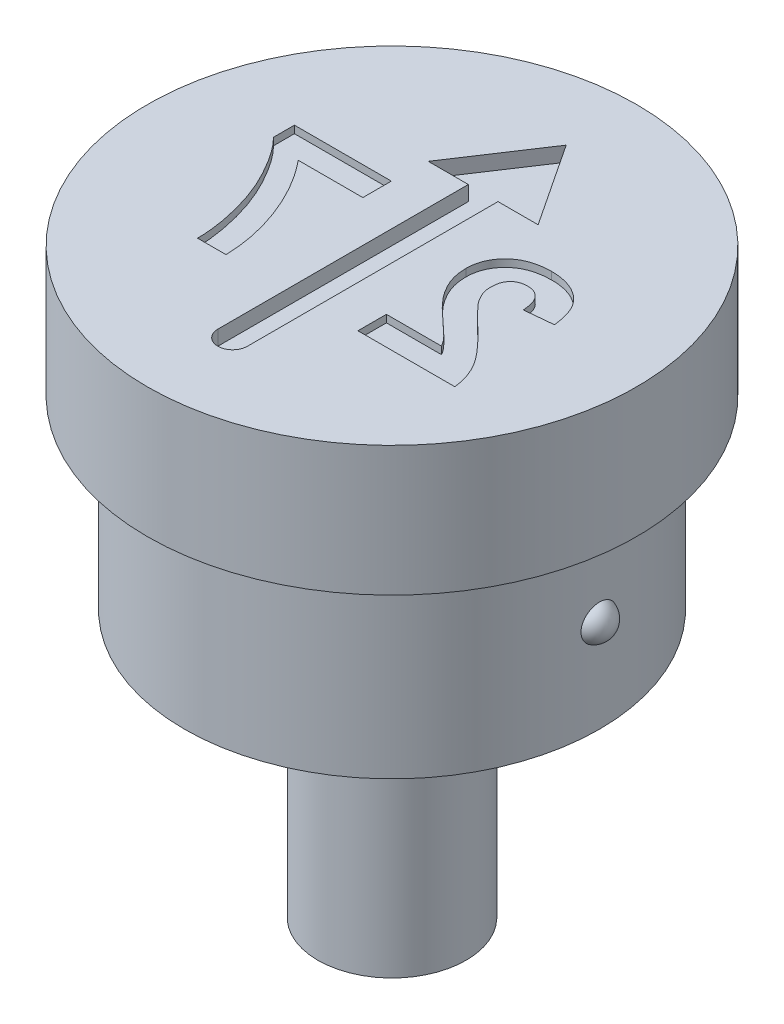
ISO-10303-21;
HEADER;
FILE_DESCRIPTION(('STEP AP214'),'2;1');
FILE_NAME('part.step','',(''),(''),'','','');
FILE_SCHEMA(('AUTOMOTIVE_DESIGN { 1 0 10303 214 1 1 1 1 }'));
ENDSEC;
DATA;
#1=APPLICATION_CONTEXT('core data for automotive mechanical design processes');
#2=APPLICATION_PROTOCOL_DEFINITION('international standard','automotive_design',2000,#1);
#3=PRODUCT_CONTEXT('',#1,'mechanical');
#4=PRODUCT('Part','Part','',(#3));
#5=PRODUCT_RELATED_PRODUCT_CATEGORY('part','',(#4));
#6=PRODUCT_DEFINITION_FORMATION('','',#4);
#7=PRODUCT_DEFINITION_CONTEXT('part definition',#1,'design');
#8=PRODUCT_DEFINITION('design','',#6,#7);
#9=PRODUCT_DEFINITION_SHAPE('','',#8);
#10=(LENGTH_UNIT() NAMED_UNIT(*) SI_UNIT(.MILLI.,.METRE.));
#11=(NAMED_UNIT(*) PLANE_ANGLE_UNIT() SI_UNIT($,.RADIAN.));
#12=(NAMED_UNIT(*) SI_UNIT($,.STERADIAN.) SOLID_ANGLE_UNIT());
#13=UNCERTAINTY_MEASURE_WITH_UNIT(LENGTH_MEASURE(1.E-05),#10,'distance_accuracy_value','');
#14=(GEOMETRIC_REPRESENTATION_CONTEXT(3) GLOBAL_UNCERTAINTY_ASSIGNED_CONTEXT((#13)) GLOBAL_UNIT_ASSIGNED_CONTEXT((#10,
#11,#12)) REPRESENTATION_CONTEXT('',''));
#15=CARTESIAN_POINT('',(0.,0.,0.));
#16=DIRECTION('',(0.,0.,1.));
#17=DIRECTION('',(1.,0.,0.));
#18=AXIS2_PLACEMENT_3D('',#15,#16,#17);
#19=CARTESIAN_POINT('',(0.,0.,0.));
#20=DIRECTION('',(0.,1.,0.));
#21=DIRECTION('',(0.,0.,1.));
#22=AXIS2_PLACEMENT_3D('',#19,#20,#21);
#23=CYLINDRICAL_SURFACE('',#22,5.6);
#24=CARTESIAN_POINT('',(0.,-3.5,0.));
#25=DIRECTION('',(0.,1.,0.));
#26=DIRECTION('',(0.,0.,1.));
#27=AXIS2_PLACEMENT_3D('',#24,#25,#26);
#28=CIRCLE('',#27,5.6);
#29=CARTESIAN_POINT('',(0.,-3.5,5.6));
#30=VERTEX_POINT('',#29);
#31=EDGE_CURVE('E416',#30,#30,#28,.T.);
#32=ORIENTED_EDGE('',*,*,#31,.F.);
#33=EDGE_LOOP('',(#32));
#34=FACE_BOUND('',#33,.T.);
#35=CARTESIAN_POINT('',(0.,-8.5,0.));
#36=DIRECTION('',(0.,1.,0.));
#37=DIRECTION('',(0.,0.,1.));
#38=AXIS2_PLACEMENT_3D('',#35,#36,#37);
#39=CIRCLE('',#38,5.6);
#40=CARTESIAN_POINT('',(0.,-8.5,5.6));
#41=VERTEX_POINT('',#40);
#42=EDGE_CURVE('E413',#41,#41,#39,.T.);
#43=ORIENTED_EDGE('',*,*,#42,.T.);
#44=EDGE_LOOP('',(#43));
#45=FACE_BOUND('',#44,.T.);
#46=CARTESIAN_POINT('',(5.57944494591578,-6.,-0.479368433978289));
#47=CARTESIAN_POINT('',(5.57944521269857,-6.02626962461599,-0.479367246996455));
#48=CARTESIAN_POINT('',(5.57963737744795,-6.05255726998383,-0.477144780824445));
#49=CARTESIAN_POINT('',(5.58038523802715,-6.10440075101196,-0.468315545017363));
#50=CARTESIAN_POINT('',(5.58094134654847,-6.12995572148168,-0.461703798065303));
#51=CARTESIAN_POINT('',(5.58235361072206,-6.17957069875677,-0.444301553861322));
#52=CARTESIAN_POINT('',(5.58320953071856,-6.20363186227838,-0.433514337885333));
#53=CARTESIAN_POINT('',(5.58512551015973,-6.24960575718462,-0.408086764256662));
#54=CARTESIAN_POINT('',(5.58618552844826,-6.27151892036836,-0.393447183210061));
#55=CARTESIAN_POINT('',(5.58839989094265,-6.31274560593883,-0.360635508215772));
#56=CARTESIAN_POINT('',(5.58955480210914,-6.33204135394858,-0.342441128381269));
#57=CARTESIAN_POINT('',(5.59182569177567,-6.36735293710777,-0.303105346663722));
#58=CARTESIAN_POINT('',(5.59294166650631,-6.38336845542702,-0.281963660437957));
#59=CARTESIAN_POINT('',(5.59502737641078,-6.41189756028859,-0.237024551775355));
#60=CARTESIAN_POINT('',(5.59599492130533,-6.42436066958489,-0.213194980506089));
#61=CARTESIAN_POINT('',(5.59765866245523,-6.44516916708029,-0.163792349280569));
#62=CARTESIAN_POINT('',(5.59835484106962,-6.45351428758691,-0.138219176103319));
#63=CARTESIAN_POINT('',(5.59940568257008,-6.46594466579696,-0.0857436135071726));
#64=CARTESIAN_POINT('',(5.59975638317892,-6.46998054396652,-0.0588294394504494));
#65=CARTESIAN_POINT('',(5.60006342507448,-6.47351960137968,-0.00470214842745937));
#66=CARTESIAN_POINT('',(5.60001975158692,-6.47302261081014,0.0225109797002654));
#67=CARTESIAN_POINT('',(5.59954158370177,-6.46749370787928,0.0766147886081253));
#68=CARTESIAN_POINT('',(5.59910503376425,-6.46243794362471,0.103503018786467));
#69=CARTESIAN_POINT('',(5.59788721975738,-6.4478891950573,0.156043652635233));
#70=CARTESIAN_POINT('',(5.5971059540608,-6.43839618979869,0.181696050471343));
#71=CARTESIAN_POINT('',(5.59528882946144,-6.41524557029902,0.230976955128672));
#72=CARTESIAN_POINT('',(5.5942534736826,-6.40159617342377,0.254609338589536));
#73=CARTESIAN_POINT('',(5.59204524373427,-6.37049174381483,0.299214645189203));
#74=CARTESIAN_POINT('',(5.59087237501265,-6.35303686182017,0.320187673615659));
#75=CARTESIAN_POINT('',(5.58853494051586,-6.3149731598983,0.358673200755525));
#76=CARTESIAN_POINT('',(5.58737039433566,-6.29439395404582,0.376214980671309));
#77=CARTESIAN_POINT('',(5.58517315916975,-6.25054281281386,0.407539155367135));
#78=CARTESIAN_POINT('',(5.58414046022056,-6.22727108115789,0.421321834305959));
#79=CARTESIAN_POINT('',(5.58233960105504,-6.17902949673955,0.444543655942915));
#80=CARTESIAN_POINT('',(5.58156807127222,-6.15408667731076,0.454038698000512));
#81=CARTESIAN_POINT('',(5.58035940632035,-6.10294450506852,0.468661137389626));
#82=CARTESIAN_POINT('',(5.57992224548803,-6.07674524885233,0.473788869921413));
#83=CARTESIAN_POINT('',(5.57943588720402,-6.02417035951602,0.479482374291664));
#84=CARTESIAN_POINT('',(5.57938210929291,-5.99780058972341,0.480102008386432));
#85=CARTESIAN_POINT('',(5.57965646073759,-5.94533439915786,0.476902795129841));
#86=CARTESIAN_POINT('',(5.57998457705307,-5.91923796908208,0.473084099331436));
#87=CARTESIAN_POINT('',(5.58098353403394,-5.8681600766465,0.461148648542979));
#88=CARTESIAN_POINT('',(5.5816530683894,-5.84317475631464,0.453048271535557));
#89=CARTESIAN_POINT('',(5.58325923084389,-5.79491022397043,0.43280349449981));
#90=CARTESIAN_POINT('',(5.58419586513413,-5.77163105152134,0.420659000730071));
#91=CARTESIAN_POINT('',(5.58623936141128,-5.72726845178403,0.392591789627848));
#92=CARTESIAN_POINT('',(5.58734730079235,-5.70620044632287,0.376644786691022));
#93=CARTESIAN_POINT('',(5.58960650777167,-5.6670016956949,0.341480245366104));
#94=CARTESIAN_POINT('',(5.59075777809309,-5.64887113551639,0.322262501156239));
#95=CARTESIAN_POINT('',(5.59299267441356,-5.61580776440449,0.280834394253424));
#96=CARTESIAN_POINT('',(5.59407523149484,-5.60091939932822,0.258588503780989));
#97=CARTESIAN_POINT('',(5.59603696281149,-5.5750297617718,0.211931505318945));
#98=CARTESIAN_POINT('',(5.59691612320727,-5.56402875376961,0.18752025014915));
#99=CARTESIAN_POINT('',(5.59838450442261,-5.54608134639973,0.136892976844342));
#100=CARTESIAN_POINT('',(5.59896991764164,-5.53918798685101,0.110658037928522));
#101=CARTESIAN_POINT('',(5.59976911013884,-5.5298520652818,0.0574020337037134));
#102=CARTESIAN_POINT('',(5.59998287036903,-5.52740973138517,0.0303809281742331));
#103=CARTESIAN_POINT('',(5.60001525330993,-5.52703712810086,-0.0238949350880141));
#104=CARTESIAN_POINT('',(5.59983091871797,-5.52914062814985,-0.0511499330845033));
#105=CARTESIAN_POINT('',(5.59908162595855,-5.53787476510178,-0.104919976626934));
#106=CARTESIAN_POINT('',(5.5985166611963,-5.54450548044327,-0.131435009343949));
#107=CARTESIAN_POINT('',(5.59706923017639,-5.56212546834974,-0.18297960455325));
#108=CARTESIAN_POINT('',(5.59618662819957,-5.57311660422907,-0.208008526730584));
#109=CARTESIAN_POINT('',(5.59420400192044,-5.59916633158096,-0.255842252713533));
#110=CARTESIAN_POINT('',(5.5931039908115,-5.61422467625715,-0.278647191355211));
#111=CARTESIAN_POINT('',(5.59082057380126,-5.64788381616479,-0.321212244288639));
#112=CARTESIAN_POINT('',(5.58963779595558,-5.66645944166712,-0.340992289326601));
#113=CARTESIAN_POINT('',(5.58731764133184,-5.70671444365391,-0.377107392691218));
#114=CARTESIAN_POINT('',(5.58618027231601,-5.72839434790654,-0.393441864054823));
#115=CARTESIAN_POINT('',(5.58409628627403,-5.77396033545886,-0.421985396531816));
#116=CARTESIAN_POINT('',(5.58314754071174,-5.79781676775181,-0.434241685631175));
#117=CARTESIAN_POINT('',(5.5815344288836,-5.8472564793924,-0.454508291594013));
#118=CARTESIAN_POINT('',(5.58086971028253,-5.87283757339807,-0.462523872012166));
#119=CARTESIAN_POINT('',(5.58007634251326,-5.91548411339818,-0.471975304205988));
#120=CARTESIAN_POINT('',(5.57984065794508,-5.93226396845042,-0.474743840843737));
#121=CARTESIAN_POINT('',(5.57952487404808,-5.96602670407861,-0.478440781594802));
#122=CARTESIAN_POINT('',(5.57944477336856,-5.98300958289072,-0.479369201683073));
#123=CARTESIAN_POINT('',(5.57944494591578,-6.,-0.479368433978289));
#124=B_SPLINE_CURVE_WITH_KNOTS('',3,(#46,#47,#48,#49,#50,#51,#52,#53,#54,#55,#56,#57,#58,#59,
#60,#61,#62,#63,#64,#65,#66,#67,#68,#69,#70,#71,#72,#73,#74,#75,#76,#77,#78,#79,#80,#81,#82,#83,
#84,#85,#86,#87,#88,#89,#90,#91,#92,#93,#94,#95,#96,#97,#98,#99,#100,#101,#102,#103,#104,#105,
#106,#107,#108,#109,#110,#111,#112,#113,#114,#115,#116,#117,#118,#119,#120,#121,#122,#123),
.UNSPECIFIED.,.T.,.F.,(4,2,2,2,2,2,2,2,2,2,2,2,2,2,2,2,2,2,2,2,2,2,2,2,2,2,2,2,2,2,2,2,2,2,2,2,
2,2,4),(0.,0.0787464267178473,0.15758230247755,0.236356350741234,0.315114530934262,
0.394383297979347,0.473659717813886,0.554012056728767,0.634369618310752,0.715638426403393,
0.796910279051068,0.878609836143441,0.960309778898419,1.0418492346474,1.12338546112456,
1.20419221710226,1.28499286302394,1.36470730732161,1.44441563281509,1.52317002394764,
1.60192172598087,1.6803743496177,1.75882879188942,1.8377983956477,1.91677297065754,
1.99677014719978,2.07677276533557,2.15778720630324,2.23880579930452,2.32042831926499,
2.40205225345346,2.4837111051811,2.56536500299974,2.64645527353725,2.72755934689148,
2.80768853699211,2.88771803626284,2.93864934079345,2.98958020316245),.UNSPECIFIED.);
#125=CARTESIAN_POINT('',(5.57944494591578,-6.,-0.479368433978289));
#126=VERTEX_POINT('',#125);
#127=EDGE_CURVE('E41',#126,#126,#124,.T.);
#128=ORIENTED_EDGE('',*,*,#127,.T.);
#129=EDGE_LOOP('',(#128));
#130=FACE_BOUND('',#129,.T.);
#131=ADVANCED_FACE('F37',(#34,#45,#130),#23,.T.);
#132=CARTESIAN_POINT('',(0.,0.,0.));
#133=DIRECTION('',(0.,1.,0.));
#134=DIRECTION('',(0.,0.,1.));
#135=AXIS2_PLACEMENT_3D('',#132,#133,#134);
#136=PLANE('',#135);
#137=DIRECTION('',(-1.,0.,0.));
#138=VECTOR('',#137,1.);
#139=CARTESIAN_POINT('',(3.01490250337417,0.,1.67917753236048));
#140=LINE('',#139,#138);
#141=CARTESIAN_POINT('',(3.01490250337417,0.,1.67917753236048));
#142=VERTEX_POINT('',#141);
#143=CARTESIAN_POINT('',(1.52852429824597,0.,1.67917753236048));
#144=VERTEX_POINT('',#143);
#145=EDGE_CURVE('E58',#142,#144,#140,.T.);
#146=ORIENTED_EDGE('',*,*,#145,.F.);
#147=CARTESIAN_POINT('',(1.91634481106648,0.,0.539754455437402));
#148=CARTESIAN_POINT('',(1.92851118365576,0.,0.555078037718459));
#149=CARTESIAN_POINT('',(1.95456873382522,0.,0.587897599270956));
#150=CARTESIAN_POINT('',(1.99889947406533,0.,0.638221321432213));
#151=CARTESIAN_POINT('',(2.05027498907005,0.,0.693190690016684));
#152=CARTESIAN_POINT('',(2.10796962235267,0.,0.753834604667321));
#153=CARTESIAN_POINT('',(2.17388914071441,0.,0.818005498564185));
#154=CARTESIAN_POINT('',(2.24566175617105,0.,0.888386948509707));
#155=CARTESIAN_POINT('',(2.32644567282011,0.,0.961378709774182));
#156=CARTESIAN_POINT('',(2.41011823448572,0.,1.03880157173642));
#157=CARTESIAN_POINT('',(2.49415449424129,0.,1.11415615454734));
#158=CARTESIAN_POINT('',(2.57139593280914,0.,1.18572630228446));
#159=CARTESIAN_POINT('',(2.64155686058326,0.,1.24905051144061));
#160=CARTESIAN_POINT('',(2.70136975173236,0.,1.30762456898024));
#161=CARTESIAN_POINT('',(2.75435278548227,0.,1.35745083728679));
#162=CARTESIAN_POINT('',(2.79859627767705,0.,1.40108434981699));
#163=CARTESIAN_POINT('',(2.83492812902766,0.,1.43746877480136));
#164=CARTESIAN_POINT('',(2.88499108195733,0.,1.49418286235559));
#165=CARTESIAN_POINT('',(2.94869050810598,0.,1.57088868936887));
#166=CARTESIAN_POINT('',(2.99350565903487,0.,1.64418327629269));
#167=CARTESIAN_POINT('',(3.01490250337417,0.,1.67917753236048));
#168=B_SPLINE_CURVE_WITH_KNOTS('',3,(#147,#148,#149,#150,#151,#152,#153,#154,#155,#156,#157,
#158,#159,#160,#161,#162,#163,#164,#165,#166,#167),.UNSPECIFIED.,.F.,.F.,(4,1,1,1,1,1,1,1,1,1,1,
1,1,1,1,1,1,1,4),(0.,0.0369753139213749,0.0791925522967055,0.126700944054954,0.179184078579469,
0.23736864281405,0.300558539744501,0.369153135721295,0.443112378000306,0.516018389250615,
0.582473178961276,0.642136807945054,0.694619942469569,0.740679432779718,0.779589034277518,
0.812073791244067,0.837814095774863,0.922564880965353,1.),.UNSPECIFIED.);
#169=CARTESIAN_POINT('',(1.91634481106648,0.,0.539754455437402));
#170=VERTEX_POINT('',#169);
#171=EDGE_CURVE('E243',#170,#142,#168,.T.);
#172=ORIENTED_EDGE('',*,*,#171,.F.);
#173=CARTESIAN_POINT('',(1.52852429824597,0.,-0.463450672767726));
#174=CARTESIAN_POINT('',(1.52950294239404,0.,-0.419848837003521));
#175=CARTESIAN_POINT('',(1.53144442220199,0.,-0.33334948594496));
#176=CARTESIAN_POINT('',(1.55003265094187,0.,-0.205477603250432));
#177=CARTESIAN_POINT('',(1.57843184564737,0.,-0.0805544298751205));
#178=CARTESIAN_POINT('',(1.6204036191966,0.,0.0417253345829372));
#179=CARTESIAN_POINT('',(1.67360610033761,0.,0.164294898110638));
#180=CARTESIAN_POINT('',(1.74218537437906,0.,0.287429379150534));
#181=CARTESIAN_POINT('',(1.82181109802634,0.,0.414842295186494));
#182=CARTESIAN_POINT('',(1.88415490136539,0.,0.497220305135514));
#183=CARTESIAN_POINT('',(1.91634481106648,0.,0.539754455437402));
#184=B_SPLINE_CURVE_WITH_KNOTS('',3,(#173,#174,#175,#176,#177,#178,#179,#180,#181,#182,#183),
.UNSPECIFIED.,.F.,.F.,(4,1,1,1,1,1,1,1,4),(0.,0.119176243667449,0.236427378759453,
0.352663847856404,0.469086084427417,0.589462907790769,0.717601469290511,0.854189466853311,1.),.UNSPECIFIED.);
#185=CARTESIAN_POINT('',(1.52852429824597,0.,-0.463450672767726));
#186=VERTEX_POINT('',#185);
#187=EDGE_CURVE('E246',#186,#170,#184,.T.);
#188=ORIENTED_EDGE('',*,*,#187,.F.);
#189=CARTESIAN_POINT('',(2.75608840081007,0.,-1.55159169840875));
#190=CARTESIAN_POINT('',(2.70957963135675,0.,-1.55069782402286));
#191=CARTESIAN_POINT('',(2.61899796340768,0.,-1.54895689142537));
#192=CARTESIAN_POINT('',(2.48676480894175,0.,-1.5345802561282));
#193=CARTESIAN_POINT('',(2.36254126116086,0.,-1.50951250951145));
#194=CARTESIAN_POINT('',(2.24524127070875,0.,-1.47630673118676));
#195=CARTESIAN_POINT('',(2.13606944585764,0.,-1.43197458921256));
#196=CARTESIAN_POINT('',(2.03411606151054,0.,-1.37837887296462));
#197=CARTESIAN_POINT('',(1.94098568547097,0.,-1.31348551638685));
#198=CARTESIAN_POINT('',(1.85529008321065,0.,-1.24083343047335));
#199=CARTESIAN_POINT('',(1.77868507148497,0.,-1.16093969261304));
#200=CARTESIAN_POINT('',(1.71158601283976,0.,-1.07571951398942));
#201=CARTESIAN_POINT('',(1.65537064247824,0.,-0.985232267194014));
#202=CARTESIAN_POINT('',(1.60819731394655,0.,-0.890580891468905));
#203=CARTESIAN_POINT('',(1.57317143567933,0.,-0.790242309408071));
#204=CARTESIAN_POINT('',(1.54765005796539,0.,-0.685603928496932));
#205=CARTESIAN_POINT('',(1.53072835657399,0.,-0.576177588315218));
#206=CARTESIAN_POINT('',(1.52926710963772,0.,-0.501441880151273));
#207=CARTESIAN_POINT('',(1.52852429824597,0.,-0.463450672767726));
#208=B_SPLINE_CURVE_WITH_KNOTS('',3,(#189,#190,#191,#192,#193,#194,#195,#196,#197,#198,#199,
#200,#201,#202,#203,#204,#205,#206,#207),.UNSPECIFIED.,.F.,.F.,(4,1,1,1,1,1,1,1,1,1,1,1,1,1,1,1,
4),(0.,0.0756723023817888,0.147381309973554,0.216084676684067,0.28169803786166,
0.345459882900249,0.407485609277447,0.46873129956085,0.529782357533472,0.590032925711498,
0.648548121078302,0.70595351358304,0.763101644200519,0.820289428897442,0.878479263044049,
0.938226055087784,1.),.UNSPECIFIED.);
#209=CARTESIAN_POINT('',(2.75608840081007,0.,-1.55159169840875));
#210=VERTEX_POINT('',#209);
#211=EDGE_CURVE('E552',#210,#186,#208,.T.);
#212=ORIENTED_EDGE('',*,*,#211,.F.);
#213=CARTESIAN_POINT('',(4.04134481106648,0.,-0.344860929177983));
#214=CARTESIAN_POINT('',(4.0351603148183,0.,-0.396793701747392));
#215=CARTESIAN_POINT('',(4.02316956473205,0.,-0.497483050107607));
#216=CARTESIAN_POINT('',(3.99324644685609,0.,-0.642107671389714));
#217=CARTESIAN_POINT('',(3.95534992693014,0.,-0.775530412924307));
#218=CARTESIAN_POINT('',(3.90767335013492,0.,-0.897503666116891));
#219=CARTESIAN_POINT('',(3.85218724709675,0.,-1.00880306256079));
#220=CARTESIAN_POINT('',(3.78606136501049,0.,-1.10775848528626));
#221=CARTESIAN_POINT('',(3.7116062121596,0.,-1.19546608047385));
#222=CARTESIAN_POINT('',(3.62875744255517,0.,-1.27187916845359));
#223=CARTESIAN_POINT('',(3.53804175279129,0.,-1.33724083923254));
#224=CARTESIAN_POINT('',(3.44285191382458,0.,-1.39558616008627));
#225=CARTESIAN_POINT('',(3.34132765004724,0.,-1.44344787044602));
#226=CARTESIAN_POINT('',(3.23458674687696,0.,-1.4828931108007));
#227=CARTESIAN_POINT('',(3.12267744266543,0.,-1.51441743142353));
#228=CARTESIAN_POINT('',(3.00508214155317,0.,-1.53526088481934));
#229=CARTESIAN_POINT('',(2.88252659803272,0.,-1.54992225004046));
#230=CARTESIAN_POINT('',(2.79886967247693,0.,-1.55102682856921));
#231=CARTESIAN_POINT('',(2.75608840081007,0.,-1.55159169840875));
#232=B_SPLINE_CURVE_WITH_KNOTS('',3,(#213,#214,#215,#216,#217,#218,#219,#220,#221,#222,#223,
#224,#225,#226,#227,#228,#229,#230,#231),.UNSPECIFIED.,.F.,.F.,(4,1,1,1,1,1,1,1,1,1,1,1,1,1,1,1,
4),(0.,0.0794357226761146,0.154013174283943,0.224141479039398,0.289934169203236,
0.352732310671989,0.41272577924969,0.470302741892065,0.527168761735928,0.583502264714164,
0.639948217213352,0.696584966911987,0.753726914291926,0.812707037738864,0.872963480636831,
0.93503486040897,1.),.UNSPECIFIED.);
#233=CARTESIAN_POINT('',(4.04134481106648,0.,-0.344860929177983));
#234=VERTEX_POINT('',#233);
#235=EDGE_CURVE('E560',#234,#210,#232,.T.);
#236=ORIENTED_EDGE('',*,*,#235,.F.);
#237=DIRECTION('',(0.995240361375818,0.,-0.0974506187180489));
#238=VECTOR('',#237,1.);
#239=CARTESIAN_POINT('',(3.27211404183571,0.,-0.26954041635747));
#240=LINE('',#239,#238);
#241=CARTESIAN_POINT('',(3.27211404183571,0.,-0.26954041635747));
#242=VERTEX_POINT('',#241);
#243=EDGE_CURVE('E568',#242,#234,#240,.T.);
#244=ORIENTED_EDGE('',*,*,#243,.F.);
#245=CARTESIAN_POINT('',(2.77211404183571,0.,-0.884925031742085));
#246=CARTESIAN_POINT('',(2.80700299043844,0.,-0.883344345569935));
#247=CARTESIAN_POINT('',(2.87440090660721,0.,-0.880290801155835));
#248=CARTESIAN_POINT('',(2.97018796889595,0.,-0.853615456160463));
#249=CARTESIAN_POINT('',(3.05398396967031,0.,-0.807437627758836));
#250=CARTESIAN_POINT('',(3.1137014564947,0.,-0.754813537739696));
#251=CARTESIAN_POINT('',(3.15404345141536,0.,-0.70364043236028));
#252=CARTESIAN_POINT('',(3.18153107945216,0.,-0.659046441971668));
#253=CARTESIAN_POINT('',(3.20522326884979,0.,-0.608373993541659));
#254=CARTESIAN_POINT('',(3.22621652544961,0.,-0.552193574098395));
#255=CARTESIAN_POINT('',(3.24279882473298,0.,-0.489861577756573));
#256=CARTESIAN_POINT('',(3.25615317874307,0.,-0.421852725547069));
#257=CARTESIAN_POINT('',(3.26691485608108,0.,-0.347801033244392));
#258=CARTESIAN_POINT('',(3.27033725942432,0.,-0.296285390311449));
#259=CARTESIAN_POINT('',(3.27211404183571,0.,-0.26954041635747));
#260=B_SPLINE_CURVE_WITH_KNOTS('',3,(#245,#246,#247,#248,#249,#250,#251,#252,#253,#254,#255,
#256,#257,#258,#259),.UNSPECIFIED.,.F.,.F.,(4,1,1,1,1,1,1,1,1,1,1,1,4),(0.,0.116899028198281,
0.225823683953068,0.330086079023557,0.435451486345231,0.490306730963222,0.548244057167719,
0.610766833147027,0.677675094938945,0.749188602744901,0.826858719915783,0.910111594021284,1.),.UNSPECIFIED.);
#261=CARTESIAN_POINT('',(2.77211404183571,0.,-0.884925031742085));
#262=VERTEX_POINT('',#261);
#263=EDGE_CURVE('E574',#262,#242,#260,.T.);
#264=ORIENTED_EDGE('',*,*,#263,.F.);
#265=CARTESIAN_POINT('',(2.29775506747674,0.,-0.360085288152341));
#266=CARTESIAN_POINT('',(2.2991957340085,0.,-0.399994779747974));
#267=CARTESIAN_POINT('',(2.30192136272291,0.,-0.475500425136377));
#268=CARTESIAN_POINT('',(2.32477623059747,0.,-0.582052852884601));
#269=CARTESIAN_POINT('',(2.36530562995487,0.,-0.673649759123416));
#270=CARTESIAN_POINT('',(2.42110715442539,0.,-0.750572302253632));
#271=CARTESIAN_POINT('',(2.49166829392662,0.,-0.810840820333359));
#272=CARTESIAN_POINT('',(2.57415631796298,0.,-0.855373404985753));
#273=CARTESIAN_POINT('',(2.66977871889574,0.,-0.879994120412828));
#274=CARTESIAN_POINT('',(2.7369877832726,0.,-0.883232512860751));
#275=CARTESIAN_POINT('',(2.77211404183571,0.,-0.884925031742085));
#276=B_SPLINE_CURVE_WITH_KNOTS('',3,(#265,#266,#267,#268,#269,#270,#271,#272,#273,#274,#275),
.UNSPECIFIED.,.F.,.F.,(4,1,1,1,1,1,1,1,4),(0.,0.149140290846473,0.282161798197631,
0.404655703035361,0.521109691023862,0.634416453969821,0.748796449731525,0.868710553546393,1.),.UNSPECIFIED.);
#277=CARTESIAN_POINT('',(2.29775506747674,0.,-0.360085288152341));
#278=VERTEX_POINT('',#277);
#279=EDGE_CURVE('E579',#278,#262,#276,.T.);
#280=ORIENTED_EDGE('',*,*,#279,.F.);
#281=CARTESIAN_POINT('',(2.44999865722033,0.,0.102254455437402));
#282=CARTESIAN_POINT('',(2.42683885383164,0.,0.0637835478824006));
#283=CARTESIAN_POINT('',(2.38216627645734,0.,-0.0104223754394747));
#284=CARTESIAN_POINT('',(2.33317908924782,0.,-0.127112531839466));
#285=CARTESIAN_POINT('',(2.30377515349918,0.,-0.243778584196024));
#286=CARTESIAN_POINT('',(2.29974013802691,0.,-0.321734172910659));
#287=CARTESIAN_POINT('',(2.29775506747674,0.,-0.360085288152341));
#288=B_SPLINE_CURVE_WITH_KNOTS('',3,(#281,#282,#283,#284,#285,#286,#287),.UNSPECIFIED.,.F.,.F.,
(4,1,1,1,4),(0.,0.272795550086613,0.526191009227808,0.766904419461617,1.),.UNSPECIFIED.);
#289=CARTESIAN_POINT('',(2.44999865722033,0.,0.102254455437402));
#290=VERTEX_POINT('',#289);
#291=EDGE_CURVE('E587',#290,#278,#288,.T.);
#292=ORIENTED_EDGE('',*,*,#291,.F.);
#293=CARTESIAN_POINT('',(3.06217814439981,0.,0.748087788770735));
#294=CARTESIAN_POINT('',(3.02263002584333,0.,0.709913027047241));
#295=CARTESIAN_POINT('',(2.947342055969,0.,0.637239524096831));
#296=CARTESIAN_POINT('',(2.84013184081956,0.,0.533174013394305));
#297=CARTESIAN_POINT('',(2.74588301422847,0.,0.437508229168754));
#298=CARTESIAN_POINT('',(2.66262496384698,0.,0.352721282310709));
#299=CARTESIAN_POINT('',(2.59228106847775,0.,0.276654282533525));
#300=CARTESIAN_POINT('',(2.53392601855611,0.,0.210501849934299));
#301=CARTESIAN_POINT('',(2.48682075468,0.,0.153994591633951));
#302=CARTESIAN_POINT('',(2.46130850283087,0.,0.118146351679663));
#303=CARTESIAN_POINT('',(2.44999865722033,0.,0.102254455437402));
#304=B_SPLINE_CURVE_WITH_KNOTS('',3,(#293,#294,#295,#296,#297,#298,#299,#300,#301,#302,#303),
.UNSPECIFIED.,.F.,.F.,(4,1,1,1,1,1,1,1,4),(0.,0.18509006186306,0.352356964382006,
0.503079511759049,0.637279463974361,0.752473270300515,0.851885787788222,0.934339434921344,1.),.UNSPECIFIED.);
#305=CARTESIAN_POINT('',(3.06217814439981,0.,0.748087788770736));
#306=VERTEX_POINT('',#305);
#307=EDGE_CURVE('E595',#306,#290,#304,.T.);
#308=ORIENTED_EDGE('',*,*,#307,.F.);
#309=CARTESIAN_POINT('',(4.14390891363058,0.,2.44840830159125));
#310=CARTESIAN_POINT('',(4.1350538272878,0.,2.38266637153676));
#311=CARTESIAN_POINT('',(4.11734861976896,0.,2.25121937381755));
#312=CARTESIAN_POINT('',(4.06261044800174,0.,2.05920839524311));
#313=CARTESIAN_POINT('',(3.98955373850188,0.,1.87183848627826));
#314=CARTESIAN_POINT('',(3.91026455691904,0.,1.71936486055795));
#315=CARTESIAN_POINT('',(3.8314026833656,0.,1.59662883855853));
#316=CARTESIAN_POINT('',(3.75985130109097,0.,1.49605799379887));
#317=CARTESIAN_POINT('',(3.67449312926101,0.,1.38905493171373));
#318=CARTESIAN_POINT('',(3.57656680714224,0.,1.27475584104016));
#319=CARTESIAN_POINT('',(3.46661351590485,0.,1.15280342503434));
#320=CARTESIAN_POINT('',(3.34381293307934,0.,1.02365107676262));
#321=CARTESIAN_POINT('',(3.20757928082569,0.,0.887917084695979));
#322=CARTESIAN_POINT('',(3.11173647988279,0.,0.795747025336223));
#323=CARTESIAN_POINT('',(3.06217814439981,0.,0.748087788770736));
#324=B_SPLINE_CURVE_WITH_KNOTS('',3,(#309,#310,#311,#312,#313,#314,#315,#316,#317,#318,#319,
#320,#321,#322,#323),.UNSPECIFIED.,.F.,.F.,(4,1,1,1,1,1,1,1,1,1,1,1,4),(0.,0.0963574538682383,
0.192660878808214,0.289454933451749,0.388479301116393,0.441921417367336,0.501521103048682,
0.567882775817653,0.640891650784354,0.72037065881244,0.806636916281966,0.900015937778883,1.),.UNSPECIFIED.);
#325=CARTESIAN_POINT('',(4.14390891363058,0.,2.44840830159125));
#326=VERTEX_POINT('',#325);
#327=EDGE_CURVE('E603',#326,#306,#324,.T.);
#328=ORIENTED_EDGE('',*,*,#327,.F.);
#329=DIRECTION('',(1.,0.,0.));
#330=VECTOR('',#329,1.);
#331=CARTESIAN_POINT('',(1.52852429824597,0.,2.44840830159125));
#332=LINE('',#331,#330);
#333=CARTESIAN_POINT('',(1.52852429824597,0.,2.44840830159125));
#334=VERTEX_POINT('',#333);
#335=EDGE_CURVE('E611',#334,#326,#332,.T.);
#336=ORIENTED_EDGE('',*,*,#335,.F.);
#337=DIRECTION('',(0.,0.,1.));
#338=VECTOR('',#337,1.);
#339=CARTESIAN_POINT('',(1.52852429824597,0.,1.67917753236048));
#340=LINE('',#339,#338);
#341=EDGE_CURVE('E617',#144,#334,#340,.T.);
#342=ORIENTED_EDGE('',*,*,#341,.F.);
#343=EDGE_LOOP('',(#146,#172,#188,#212,#236,#244,#264,#280,#292,#308,#328,#336,#342));
#344=FACE_BOUND('',#343,.T.);
#345=DIRECTION('',(1.,0.,0.));
#346=VECTOR('',#345,1.);
#347=CARTESIAN_POINT('',(-3.26202057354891,0.,-0.731078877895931));
#348=LINE('',#347,#346);
#349=CARTESIAN_POINT('',(-3.26202057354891,0.,-0.731078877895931));
#350=VERTEX_POINT('',#349);
#351=CARTESIAN_POINT('',(-1.51762954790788,0.,-0.731078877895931));
#352=VERTEX_POINT('',#351);
#353=EDGE_CURVE('E66',#350,#352,#348,.T.);
#354=ORIENTED_EDGE('',*,*,#353,.F.);
#355=CARTESIAN_POINT('',(-2.03045006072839,0.,2.44840830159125));
#356=CARTESIAN_POINT('',(-2.03302219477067,0.,2.38026348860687));
#357=CARTESIAN_POINT('',(-2.03819503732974,0.,2.24321682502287));
#358=CARTESIAN_POINT('',(-2.05754897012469,0.,2.037514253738));
#359=CARTESIAN_POINT('',(-2.08794640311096,0.,1.83104573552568));
#360=CARTESIAN_POINT('',(-2.12570205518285,0.,1.6233340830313));
#361=CARTESIAN_POINT('',(-2.17554892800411,0.,1.41488496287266));
#362=CARTESIAN_POINT('',(-2.23243948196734,0.,1.20492621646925));
#363=CARTESIAN_POINT('',(-2.30135383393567,0.,0.994579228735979));
#364=CARTESIAN_POINT('',(-2.37860497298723,0.,0.78424619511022));
#365=CARTESIAN_POINT('',(-2.46388616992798,0.,0.575924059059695));
#366=CARTESIAN_POINT('',(-2.55683067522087,0.,0.372196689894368));
#367=CARTESIAN_POINT('',(-2.6571982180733,0.,0.174335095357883));
#368=CARTESIAN_POINT('',(-2.76368353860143,0.,-0.0183559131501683));
#369=CARTESIAN_POINT('',(-2.87752544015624,0.,-0.205256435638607));
#370=CARTESIAN_POINT('',(-2.99880963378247,0.,-0.386163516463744));
#371=CARTESIAN_POINT('',(-3.12581573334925,0.,-0.562385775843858));
#372=CARTESIAN_POINT('',(-3.21662660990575,0.,-0.674857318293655));
#373=CARTESIAN_POINT('',(-3.26202057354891,0.,-0.731078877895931));
#374=B_SPLINE_CURVE_WITH_KNOTS('',3,(#355,#356,#357,#358,#359,#360,#361,#362,#363,#364,#365,
#366,#367,#368,#369,#370,#371,#372,#373),.UNSPECIFIED.,.F.,.F.,(4,1,1,1,1,1,1,1,1,1,1,1,1,1,1,1,
4),(0.,0.0589531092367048,0.118561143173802,0.178522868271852,0.239353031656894,
0.301026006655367,0.363773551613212,0.427382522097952,0.492333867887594,0.557475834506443,
0.621960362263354,0.685889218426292,0.749254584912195,0.812267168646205,0.875035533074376,
0.937533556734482,1.),.UNSPECIFIED.);
#375=CARTESIAN_POINT('',(-2.03045006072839,0.,2.44840830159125));
#376=VERTEX_POINT('',#375);
#377=EDGE_CURVE('E328',#376,#350,#374,.T.);
#378=ORIENTED_EDGE('',*,*,#377,.F.);
#379=DIRECTION('',(1.,0.,0.));
#380=VECTOR('',#379,1.);
#381=CARTESIAN_POINT('',(-2.79968082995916,0.,2.44840830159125));
#382=LINE('',#381,#380);
#383=CARTESIAN_POINT('',(-2.79968082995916,0.,2.44840830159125));
#384=VERTEX_POINT('',#383);
#385=EDGE_CURVE('E322',#384,#376,#382,.T.);
#386=ORIENTED_EDGE('',*,*,#385,.F.);
#387=CARTESIAN_POINT('',(-4.1330141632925,0.,-0.936207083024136));
#388=CARTESIAN_POINT('',(-4.10573076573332,0.,-0.90844711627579));
#389=CARTESIAN_POINT('',(-4.04964393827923,0.,-0.851380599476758));
#390=CARTESIAN_POINT('',(-3.96930504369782,0.,-0.757985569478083));
#391=CARTESIAN_POINT('',(-3.88777581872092,0.,-0.656635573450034));
#392=CARTESIAN_POINT('',(-3.80676112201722,0.,-0.545964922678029));
#393=CARTESIAN_POINT('',(-3.72374265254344,0.,-0.427721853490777));
#394=CARTESIAN_POINT('',(-3.64236877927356,0.,-0.299639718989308));
#395=CARTESIAN_POINT('',(-3.55983746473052,0.,-0.163380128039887));
#396=CARTESIAN_POINT('',(-3.4487242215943,0.,0.0293593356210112));
#397=CARTESIAN_POINT('',(-3.31884670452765,0.,0.281136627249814));
#398=CARTESIAN_POINT('',(-3.1814431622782,0.,0.594108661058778));
#399=CARTESIAN_POINT('',(-3.06438163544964,0.,0.916692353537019));
#400=CARTESIAN_POINT('',(-2.98422304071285,0.,1.19155744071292));
#401=CARTESIAN_POINT('',(-2.93006300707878,0.,1.41186138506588));
#402=CARTESIAN_POINT('',(-2.89467746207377,0.,1.572952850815));
#403=CARTESIAN_POINT('',(-2.86489034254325,0.,1.72951099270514));
#404=CARTESIAN_POINT('',(-2.84065854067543,0.,1.88181095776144));
#405=CARTESIAN_POINT('',(-2.8225736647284,0.,2.02992222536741));
#406=CARTESIAN_POINT('',(-2.80828352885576,0.,2.17332986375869));
#407=CARTESIAN_POINT('',(-2.80123337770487,0.,2.31238357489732));
#408=CARTESIAN_POINT('',(-2.80019305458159,0.,2.40353031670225));
#409=CARTESIAN_POINT('',(-2.79968082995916,0.,2.44840830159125));
#410=B_SPLINE_CURVE_WITH_KNOTS('',3,(#387,#388,#389,#390,#391,#392,#393,#394,#395,#396,#397,
#398,#399,#400,#401,#402,#403,#404,#405,#406,#407,#408,#409),.UNSPECIFIED.,.F.,.F.,(4,1,1,1,1,1,
1,1,1,1,1,1,1,1,1,1,1,1,1,1,4),(0.,0.0314272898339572,0.0646054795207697,0.0994393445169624,
0.136456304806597,0.175351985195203,0.216100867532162,0.258977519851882,0.304007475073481,
0.395756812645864,0.487615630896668,0.579873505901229,0.672707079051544,0.718694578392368,
0.76307923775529,0.80589344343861,0.847386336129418,0.88760014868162,0.926386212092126,
0.963754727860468,1.),.UNSPECIFIED.);
#411=CARTESIAN_POINT('',(-4.1330141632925,0.,-0.936207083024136));
#412=VERTEX_POINT('',#411);
#413=EDGE_CURVE('E317',#412,#384,#410,.T.);
#414=ORIENTED_EDGE('',*,*,#413,.F.);
#415=DIRECTION('',(0.,0.,1.));
#416=VECTOR('',#415,1.);
#417=CARTESIAN_POINT('',(-4.1330141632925,0.,-1.5003096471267));
#418=LINE('',#417,#416);
#419=CARTESIAN_POINT('',(-4.1330141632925,0.,-1.5003096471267));
#420=VERTEX_POINT('',#419);
#421=EDGE_CURVE('E314',#420,#412,#418,.T.);
#422=ORIENTED_EDGE('',*,*,#421,.F.);
#423=DIRECTION('',(-1.,0.,0.));
#424=VECTOR('',#423,1.);
#425=CARTESIAN_POINT('',(-1.51762954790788,0.,-1.5003096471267));
#426=LINE('',#425,#424);
#427=CARTESIAN_POINT('',(-1.51762954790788,0.,-1.5003096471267));
#428=VERTEX_POINT('',#427);
#429=EDGE_CURVE('E311',#428,#420,#426,.T.);
#430=ORIENTED_EDGE('',*,*,#429,.F.);
#431=DIRECTION('',(0.,0.,-1.));
#432=VECTOR('',#431,1.);
#433=CARTESIAN_POINT('',(-1.51762954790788,0.,-0.731078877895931));
#434=LINE('',#433,#432);
#435=EDGE_CURVE('E308',#352,#428,#434,.T.);
#436=ORIENTED_EDGE('',*,*,#435,.F.);
#437=EDGE_LOOP('',(#354,#378,#386,#414,#422,#430,#436));
#438=FACE_BOUND('',#437,.T.);
#439=DIRECTION('',(-0.551936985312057,0.,-0.833885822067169));
#440=VECTOR('',#439,1.);
#441=CARTESIAN_POINT('',(1.48262365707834,0.,-2.46));
#442=LINE('',#441,#440);
#443=CARTESIAN_POINT('',(1.48262365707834,0.,-2.46));
#444=VERTEX_POINT('',#443);
#445=CARTESIAN_POINT('',(0.,0.,-4.7));
#446=VERTEX_POINT('',#445);
#447=EDGE_CURVE('E373',#444,#446,#442,.T.);
#448=ORIENTED_EDGE('',*,*,#447,.F.);
#449=DIRECTION('',(1.,0.,0.));
#450=VECTOR('',#449,1.);
#451=CARTESIAN_POINT('',(0.400000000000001,0.,-2.46));
#452=LINE('',#451,#450);
#453=CARTESIAN_POINT('',(0.400000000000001,0.,-2.46));
#454=VERTEX_POINT('',#453);
#455=EDGE_CURVE('E354',#454,#444,#452,.T.);
#456=ORIENTED_EDGE('',*,*,#455,.F.);
#457=DIRECTION('',(0.,0.,-1.));
#458=VECTOR('',#457,1.);
#459=CARTESIAN_POINT('',(0.400000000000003,0.,4.3));
#460=LINE('',#459,#458);
#461=CARTESIAN_POINT('',(0.400000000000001,0.,4.3));
#462=VERTEX_POINT('',#461);
#463=EDGE_CURVE('E388',#462,#454,#460,.T.);
#464=ORIENTED_EDGE('',*,*,#463,.F.);
#465=CARTESIAN_POINT('',(0.,0.,4.3));
#466=DIRECTION('',(0.,1.,0.));
#467=DIRECTION('',(0.,0.,1.));
#468=AXIS2_PLACEMENT_3D('',#465,#466,#467);
#469=CIRCLE('',#468,0.400000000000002);
#470=CARTESIAN_POINT('',(-0.400000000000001,0.,4.3));
#471=VERTEX_POINT('',#470);
#472=EDGE_CURVE('E385',#471,#462,#469,.T.);
#473=ORIENTED_EDGE('',*,*,#472,.F.);
#474=DIRECTION('',(0.,0.,1.));
#475=VECTOR('',#474,1.);
#476=CARTESIAN_POINT('',(-0.400000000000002,0.,-2.46));
#477=LINE('',#476,#475);
#478=CARTESIAN_POINT('',(-0.400000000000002,0.,-2.46));
#479=VERTEX_POINT('',#478);
#480=EDGE_CURVE('E382',#479,#471,#477,.T.);
#481=ORIENTED_EDGE('',*,*,#480,.F.);
#482=DIRECTION('',(1.,0.,0.));
#483=VECTOR('',#482,1.);
#484=CARTESIAN_POINT('',(-1.48262365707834,0.,-2.46));
#485=LINE('',#484,#483);
#486=CARTESIAN_POINT('',(-1.48262365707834,0.,-2.46));
#487=VERTEX_POINT('',#486);
#488=EDGE_CURVE('E379',#487,#479,#485,.T.);
#489=ORIENTED_EDGE('',*,*,#488,.F.);
#490=DIRECTION('',(-0.551936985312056,0.,0.833885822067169));
#491=VECTOR('',#490,1.);
#492=CARTESIAN_POINT('',(0.,0.,-4.7));
#493=LINE('',#492,#491);
#494=EDGE_CURVE('E375',#446,#487,#493,.T.);
#495=ORIENTED_EDGE('',*,*,#494,.F.);
#496=EDGE_LOOP('',(#448,#456,#464,#473,#481,#489,#495));
#497=FACE_BOUND('',#496,.T.);
#498=CARTESIAN_POINT('',(0.,0.,0.));
#499=DIRECTION('',(0.,1.,0.));
#500=DIRECTION('',(0.,0.,1.));
#501=AXIS2_PLACEMENT_3D('',#498,#499,#500);
#502=CIRCLE('',#501,6.6);
#503=CARTESIAN_POINT('',(0.,0.,6.6));
#504=VERTEX_POINT('',#503);
#505=EDGE_CURVE('E11',#504,#504,#502,.T.);
#506=ORIENTED_EDGE('',*,*,#505,.T.);
#507=EDGE_LOOP('',(#506));
#508=FACE_BOUND('',#507,.T.);
#509=ADVANCED_FACE('F39',(#344,#438,#497,#508),#136,.T.);
#510=CARTESIAN_POINT('',(0.,0.,0.));
#511=DIRECTION('',(0.,1.,0.));
#512=DIRECTION('',(0.,0.,1.));
#513=AXIS2_PLACEMENT_3D('',#510,#511,#512);
#514=CYLINDRICAL_SURFACE('',#513,6.6);
#515=CARTESIAN_POINT('',(0.,-3.5,0.));
#516=DIRECTION('',(0.,1.,0.));
#517=DIRECTION('',(0.,0.,1.));
#518=AXIS2_PLACEMENT_3D('',#515,#516,#517);
#519=CIRCLE('',#518,6.6);
#520=CARTESIAN_POINT('',(0.,-3.5,6.6));
#521=VERTEX_POINT('',#520);
#522=EDGE_CURVE('E51',#521,#521,#519,.T.);
#523=ORIENTED_EDGE('',*,*,#522,.T.);
#524=EDGE_LOOP('',(#523));
#525=FACE_BOUND('',#524,.T.);
#526=ORIENTED_EDGE('',*,*,#505,.F.);
#527=EDGE_LOOP('',(#526));
#528=FACE_BOUND('',#527,.T.);
#529=ADVANCED_FACE('F422',(#525,#528),#514,.T.);
#530=CARTESIAN_POINT('',(-6.6,-3.5,0.));
#531=DIRECTION('',(0.,-1.,0.));
#532=DIRECTION('',(0.,0.,-1.));
#533=AXIS2_PLACEMENT_3D('',#530,#531,#532);
#534=PLANE('',#533);
#535=ORIENTED_EDGE('',*,*,#31,.T.);
#536=EDGE_LOOP('',(#535));
#537=FACE_BOUND('',#536,.T.);
#538=ORIENTED_EDGE('',*,*,#522,.F.);
#539=EDGE_LOOP('',(#538));
#540=FACE_BOUND('',#539,.T.);
#541=ADVANCED_FACE('F425',(#537,#540),#534,.T.);
#542=CARTESIAN_POINT('',(-5.6,-8.5,0.));
#543=DIRECTION('',(0.,-1.,0.));
#544=DIRECTION('',(0.,0.,-1.));
#545=AXIS2_PLACEMENT_3D('',#542,#543,#544);
#546=PLANE('',#545);
#547=CARTESIAN_POINT('',(0.,-8.5,0.));
#548=DIRECTION('',(0.,1.,0.));
#549=DIRECTION('',(0.,0.,1.));
#550=AXIS2_PLACEMENT_3D('',#547,#548,#549);
#551=CIRCLE('',#550,2.);
#552=CARTESIAN_POINT('',(0.,-8.5,2.));
#553=VERTEX_POINT('',#552);
#554=EDGE_CURVE('E410',#553,#553,#551,.T.);
#555=ORIENTED_EDGE('',*,*,#554,.T.);
#556=EDGE_LOOP('',(#555));
#557=FACE_BOUND('',#556,.T.);
#558=ORIENTED_EDGE('',*,*,#42,.F.);
#559=EDGE_LOOP('',(#558));
#560=FACE_BOUND('',#559,.T.);
#561=ADVANCED_FACE('F427',(#557,#560),#546,.T.);
#562=CARTESIAN_POINT('',(0.,0.,0.));
#563=DIRECTION('',(0.,1.,0.));
#564=DIRECTION('',(0.,0.,1.));
#565=AXIS2_PLACEMENT_3D('',#562,#563,#564);
#566=CYLINDRICAL_SURFACE('',#565,2.);
#567=CARTESIAN_POINT('',(0.,-15.7,0.));
#568=DIRECTION('',(0.,1.,0.));
#569=DIRECTION('',(0.,0.,1.));
#570=AXIS2_PLACEMENT_3D('',#567,#568,#569);
#571=CIRCLE('',#570,2.);
#572=CARTESIAN_POINT('',(0.,-15.7,2.));
#573=VERTEX_POINT('',#572);
#574=EDGE_CURVE('E395',#573,#573,#571,.T.);
#575=ORIENTED_EDGE('',*,*,#574,.T.);
#576=EDGE_LOOP('',(#575));
#577=FACE_BOUND('',#576,.T.);
#578=ORIENTED_EDGE('',*,*,#554,.F.);
#579=EDGE_LOOP('',(#578));
#580=FACE_BOUND('',#579,.T.);
#581=ADVANCED_FACE('F434',(#577,#580),#566,.T.);
#582=CARTESIAN_POINT('',(-2.,-15.7,0.));
#583=DIRECTION('',(0.,-1.,0.));
#584=DIRECTION('',(0.,0.,-1.));
#585=AXIS2_PLACEMENT_3D('',#582,#583,#584);
#586=PLANE('',#585);
#587=ORIENTED_EDGE('',*,*,#574,.F.);
#588=EDGE_LOOP('',(#587));
#589=FACE_BOUND('',#588,.T.);
#590=ADVANCED_FACE('F449',(#589),#586,.T.);
#591=CARTESIAN_POINT('',(1.48262365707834,-0.4,-2.46));
#592=DIRECTION('',(0.833885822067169,0.,-0.551936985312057));
#593=DIRECTION('',(-0.551936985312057,0.,-0.833885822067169));
#594=AXIS2_PLACEMENT_3D('',#591,#592,#593);
#595=PLANE('',#594);
#596=ORIENTED_EDGE('',*,*,#447,.T.);
#597=DIRECTION('',(0.,1.,0.));
#598=VECTOR('',#597,1.);
#599=CARTESIAN_POINT('',(0.,-0.4,-4.7));
#600=LINE('',#599,#598);
#601=CARTESIAN_POINT('',(0.,-0.4,-4.7));
#602=VERTEX_POINT('',#601);
#603=EDGE_CURVE('E372',#602,#446,#600,.T.);
#604=ORIENTED_EDGE('',*,*,#603,.F.);
#605=DIRECTION('',(-0.551936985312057,0.,-0.833885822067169));
#606=VECTOR('',#605,1.);
#607=CARTESIAN_POINT('',(1.48262365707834,-0.4,-2.46));
#608=LINE('',#607,#606);
#609=CARTESIAN_POINT('',(1.48262365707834,-0.4,-2.46));
#610=VERTEX_POINT('',#609);
#611=EDGE_CURVE('E350',#610,#602,#608,.T.);
#612=ORIENTED_EDGE('',*,*,#611,.F.);
#613=DIRECTION('',(0.,1.,0.));
#614=VECTOR('',#613,1.);
#615=CARTESIAN_POINT('',(1.48262365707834,-0.4,-2.46));
#616=LINE('',#615,#614);
#617=EDGE_CURVE('E393',#610,#444,#616,.T.);
#618=ORIENTED_EDGE('',*,*,#617,.T.);
#619=EDGE_LOOP('',(#596,#604,#612,#618));
#620=FACE_BOUND('',#619,.T.);
#621=ADVANCED_FACE('F453',(#620),#595,.F.);
#622=CARTESIAN_POINT('',(0.400000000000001,-0.4,-2.46));
#623=DIRECTION('',(0.,0.,1.));
#624=DIRECTION('',(1.,0.,0.));
#625=AXIS2_PLACEMENT_3D('',#622,#623,#624);
#626=PLANE('',#625);
#627=ORIENTED_EDGE('',*,*,#455,.T.);
#628=ORIENTED_EDGE('',*,*,#617,.F.);
#629=DIRECTION('',(1.,0.,0.));
#630=VECTOR('',#629,1.);
#631=CARTESIAN_POINT('',(0.400000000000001,-0.4,-2.46));
#632=LINE('',#631,#630);
#633=CARTESIAN_POINT('',(0.400000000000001,-0.4,-2.46));
#634=VERTEX_POINT('',#633);
#635=EDGE_CURVE('E369',#634,#610,#632,.T.);
#636=ORIENTED_EDGE('',*,*,#635,.F.);
#637=DIRECTION('',(0.,1.,0.));
#638=VECTOR('',#637,1.);
#639=CARTESIAN_POINT('',(0.400000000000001,-0.4,-2.46));
#640=LINE('',#639,#638);
#641=EDGE_CURVE('E396',#634,#454,#640,.T.);
#642=ORIENTED_EDGE('',*,*,#641,.T.);
#643=EDGE_LOOP('',(#627,#628,#636,#642));
#644=FACE_BOUND('',#643,.T.);
#645=ADVANCED_FACE('F457',(#644),#626,.F.);
#646=CARTESIAN_POINT('',(0.400000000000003,-0.4,4.3));
#647=DIRECTION('',(1.,0.,0.));
#648=DIRECTION('',(0.,0.,-1.));
#649=AXIS2_PLACEMENT_3D('',#646,#647,#648);
#650=PLANE('',#649);
#651=ORIENTED_EDGE('',*,*,#463,.T.);
#652=ORIENTED_EDGE('',*,*,#641,.F.);
#653=DIRECTION('',(0.,0.,-1.));
#654=VECTOR('',#653,1.);
#655=CARTESIAN_POINT('',(0.400000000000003,-0.4,4.3));
#656=LINE('',#655,#654);
#657=CARTESIAN_POINT('',(0.400000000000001,-0.4,4.3));
#658=VERTEX_POINT('',#657);
#659=EDGE_CURVE('E366',#658,#634,#656,.T.);
#660=ORIENTED_EDGE('',*,*,#659,.F.);
#661=DIRECTION('',(0.,1.,0.));
#662=VECTOR('',#661,1.);
#663=CARTESIAN_POINT('',(0.400000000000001,-0.4,4.3));
#664=LINE('',#663,#662);
#665=EDGE_CURVE('E398',#658,#462,#664,.T.);
#666=ORIENTED_EDGE('',*,*,#665,.T.);
#667=EDGE_LOOP('',(#651,#652,#660,#666));
#668=FACE_BOUND('',#667,.T.);
#669=ADVANCED_FACE('F475',(#668),#650,.F.);
#670=CARTESIAN_POINT('',(0.,-0.4,4.3));
#671=DIRECTION('',(0.,1.,0.));
#672=DIRECTION('',(0.,0.,1.));
#673=AXIS2_PLACEMENT_3D('',#670,#671,#672);
#674=CYLINDRICAL_SURFACE('',#673,0.400000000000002);
#675=ORIENTED_EDGE('',*,*,#472,.T.);
#676=ORIENTED_EDGE('',*,*,#665,.F.);
#677=CARTESIAN_POINT('',(0.,-0.4,4.3));
#678=DIRECTION('',(0.,1.,0.));
#679=DIRECTION('',(0.,0.,1.));
#680=AXIS2_PLACEMENT_3D('',#677,#678,#679);
#681=CIRCLE('',#680,0.400000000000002);
#682=CARTESIAN_POINT('',(-0.400000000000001,-0.4,4.3));
#683=VERTEX_POINT('',#682);
#684=EDGE_CURVE('E363',#683,#658,#681,.T.);
#685=ORIENTED_EDGE('',*,*,#684,.F.);
#686=DIRECTION('',(0.,1.,0.));
#687=VECTOR('',#686,1.);
#688=CARTESIAN_POINT('',(-0.400000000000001,-0.4,4.3));
#689=LINE('',#688,#687);
#690=EDGE_CURVE('E400',#683,#471,#689,.T.);
#691=ORIENTED_EDGE('',*,*,#690,.T.);
#692=EDGE_LOOP('',(#675,#676,#685,#691));
#693=FACE_BOUND('',#692,.T.);
#694=ADVANCED_FACE('F471',(#693),#674,.F.);
#695=CARTESIAN_POINT('',(-0.400000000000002,-0.4,-2.46));
#696=DIRECTION('',(-1.,0.,0.));
#697=DIRECTION('',(0.,0.,1.));
#698=AXIS2_PLACEMENT_3D('',#695,#696,#697);
#699=PLANE('',#698);
#700=ORIENTED_EDGE('',*,*,#480,.T.);
#701=ORIENTED_EDGE('',*,*,#690,.F.);
#702=DIRECTION('',(0.,0.,1.));
#703=VECTOR('',#702,1.);
#704=CARTESIAN_POINT('',(-0.400000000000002,-0.4,-2.46));
#705=LINE('',#704,#703);
#706=CARTESIAN_POINT('',(-0.400000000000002,-0.4,-2.46));
#707=VERTEX_POINT('',#706);
#708=EDGE_CURVE('E360',#707,#683,#705,.T.);
#709=ORIENTED_EDGE('',*,*,#708,.F.);
#710=DIRECTION('',(0.,1.,0.));
#711=VECTOR('',#710,1.);
#712=CARTESIAN_POINT('',(-0.400000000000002,-0.4,-2.46));
#713=LINE('',#712,#711);
#714=EDGE_CURVE('E402',#707,#479,#713,.T.);
#715=ORIENTED_EDGE('',*,*,#714,.T.);
#716=EDGE_LOOP('',(#700,#701,#709,#715));
#717=FACE_BOUND('',#716,.T.);
#718=ADVANCED_FACE('F467',(#717),#699,.F.);
#719=CARTESIAN_POINT('',(-1.48262365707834,-0.4,-2.46));
#720=DIRECTION('',(0.,0.,1.));
#721=DIRECTION('',(1.,0.,0.));
#722=AXIS2_PLACEMENT_3D('',#719,#720,#721);
#723=PLANE('',#722);
#724=ORIENTED_EDGE('',*,*,#488,.T.);
#725=ORIENTED_EDGE('',*,*,#714,.F.);
#726=DIRECTION('',(1.,0.,0.));
#727=VECTOR('',#726,1.);
#728=CARTESIAN_POINT('',(-1.48262365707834,-0.4,-2.46));
#729=LINE('',#728,#727);
#730=CARTESIAN_POINT('',(-1.48262365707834,-0.4,-2.46));
#731=VERTEX_POINT('',#730);
#732=EDGE_CURVE('E357',#731,#707,#729,.T.);
#733=ORIENTED_EDGE('',*,*,#732,.F.);
#734=DIRECTION('',(0.,1.,0.));
#735=VECTOR('',#734,1.);
#736=CARTESIAN_POINT('',(-1.48262365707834,-0.4,-2.46));
#737=LINE('',#736,#735);
#738=EDGE_CURVE('E404',#731,#487,#737,.T.);
#739=ORIENTED_EDGE('',*,*,#738,.T.);
#740=EDGE_LOOP('',(#724,#725,#733,#739));
#741=FACE_BOUND('',#740,.T.);
#742=ADVANCED_FACE('F463',(#741),#723,.F.);
#743=CARTESIAN_POINT('',(0.,-0.4,-4.7));
#744=DIRECTION('',(-0.833885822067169,0.,-0.551936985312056));
#745=DIRECTION('',(-0.551936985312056,0.,0.833885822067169));
#746=AXIS2_PLACEMENT_3D('',#743,#744,#745);
#747=PLANE('',#746);
#748=ORIENTED_EDGE('',*,*,#494,.T.);
#749=ORIENTED_EDGE('',*,*,#738,.F.);
#750=DIRECTION('',(-0.551936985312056,0.,0.833885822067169));
#751=VECTOR('',#750,1.);
#752=CARTESIAN_POINT('',(0.,-0.4,-4.7));
#753=LINE('',#752,#751);
#754=EDGE_CURVE('E353',#602,#731,#753,.T.);
#755=ORIENTED_EDGE('',*,*,#754,.F.);
#756=ORIENTED_EDGE('',*,*,#603,.T.);
#757=EDGE_LOOP('',(#748,#749,#755,#756));
#758=FACE_BOUND('',#757,.T.);
#759=ADVANCED_FACE('F459',(#758),#747,.F.);
#760=CARTESIAN_POINT('',(0.,-0.4,4.3));
#761=DIRECTION('',(0.,1.,0.));
#762=DIRECTION('',(0.,0.,1.));
#763=AXIS2_PLACEMENT_3D('',#760,#761,#762);
#764=PLANE('',#763);
#765=ORIENTED_EDGE('',*,*,#611,.T.);
#766=ORIENTED_EDGE('',*,*,#754,.T.);
#767=ORIENTED_EDGE('',*,*,#732,.T.);
#768=ORIENTED_EDGE('',*,*,#708,.T.);
#769=ORIENTED_EDGE('',*,*,#684,.T.);
#770=ORIENTED_EDGE('',*,*,#659,.T.);
#771=ORIENTED_EDGE('',*,*,#635,.T.);
#772=EDGE_LOOP('',(#765,#766,#767,#768,#769,#770,#771));
#773=FACE_BOUND('',#772,.T.);
#774=ADVANCED_FACE('F462',(#773),#764,.T.);
#775=CARTESIAN_POINT('',(-3.26202057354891,-0.2,-0.731078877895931));
#776=DIRECTION('',(0.,0.,1.));
#777=DIRECTION('',(1.,0.,0.));
#778=AXIS2_PLACEMENT_3D('',#775,#776,#777);
#779=PLANE('',#778);
#780=ORIENTED_EDGE('',*,*,#353,.T.);
#781=DIRECTION('',(0.,1.,0.));
#782=VECTOR('',#781,1.);
#783=CARTESIAN_POINT('',(-1.51762954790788,-0.2,-0.731078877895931));
#784=LINE('',#783,#782);
#785=CARTESIAN_POINT('',(-1.51762954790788,-0.2,-0.731078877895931));
#786=VERTEX_POINT('',#785);
#787=EDGE_CURVE('E301',#786,#352,#784,.T.);
#788=ORIENTED_EDGE('',*,*,#787,.F.);
#789=DIRECTION('',(1.,0.,0.));
#790=VECTOR('',#789,1.);
#791=CARTESIAN_POINT('',(-3.26202057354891,-0.2,-0.731078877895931));
#792=LINE('',#791,#790);
#793=CARTESIAN_POINT('',(-3.26202057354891,-0.2,-0.731078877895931));
#794=VERTEX_POINT('',#793);
#795=EDGE_CURVE('E333',#794,#786,#792,.T.);
#796=ORIENTED_EDGE('',*,*,#795,.F.);
#797=DIRECTION('',(0.,1.,0.));
#798=VECTOR('',#797,1.);
#799=CARTESIAN_POINT('',(-3.26202057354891,-0.2,-0.731078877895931));
#800=LINE('',#799,#798);
#801=EDGE_CURVE('E334',#794,#350,#800,.T.);
#802=ORIENTED_EDGE('',*,*,#801,.T.);
#803=EDGE_LOOP('',(#780,#788,#796,#802));
#804=FACE_BOUND('',#803,.T.);
#805=ADVANCED_FACE('F291',(#804),#779,.F.);
#806=CARTESIAN_POINT('',(-2.03045006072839,-0.2,2.44840830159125));
#807=CARTESIAN_POINT('',(-2.03302219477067,-0.2,2.38026348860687));
#808=CARTESIAN_POINT('',(-2.03819503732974,-0.2,2.24321682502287));
#809=CARTESIAN_POINT('',(-2.05754897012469,-0.2,2.037514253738));
#810=CARTESIAN_POINT('',(-2.08794640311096,-0.2,1.83104573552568));
#811=CARTESIAN_POINT('',(-2.12570205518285,-0.2,1.6233340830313));
#812=CARTESIAN_POINT('',(-2.17554892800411,-0.2,1.41488496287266));
#813=CARTESIAN_POINT('',(-2.23243948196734,-0.2,1.20492621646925));
#814=CARTESIAN_POINT('',(-2.30135383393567,-0.2,0.994579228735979));
#815=CARTESIAN_POINT('',(-2.37860497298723,-0.2,0.78424619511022));
#816=CARTESIAN_POINT('',(-2.46388616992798,-0.2,0.575924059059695));
#817=CARTESIAN_POINT('',(-2.55683067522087,-0.2,0.372196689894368));
#818=CARTESIAN_POINT('',(-2.6571982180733,-0.2,0.174335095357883));
#819=CARTESIAN_POINT('',(-2.76368353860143,-0.2,-0.0183559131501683));
#820=CARTESIAN_POINT('',(-2.87752544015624,-0.2,-0.205256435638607));
#821=CARTESIAN_POINT('',(-2.99880963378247,-0.2,-0.386163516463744));
#822=CARTESIAN_POINT('',(-3.12581573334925,-0.2,-0.562385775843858));
#823=CARTESIAN_POINT('',(-3.21662660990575,-0.2,-0.674857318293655));
#824=CARTESIAN_POINT('',(-3.26202057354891,-0.2,-0.731078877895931));
#825=B_SPLINE_CURVE_WITH_KNOTS('',3,(#806,#807,#808,#809,#810,#811,#812,#813,#814,#815,#816,
#817,#818,#819,#820,#821,#822,#823,#824),.UNSPECIFIED.,.F.,.F.,(4,1,1,1,1,1,1,1,1,1,1,1,1,1,1,1,
4),(0.,0.0589531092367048,0.118561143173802,0.178522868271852,0.239353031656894,
0.301026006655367,0.363773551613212,0.427382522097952,0.492333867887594,0.557475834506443,
0.621960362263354,0.685889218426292,0.749254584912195,0.812267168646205,0.875035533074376,
0.937533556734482,1.),.UNSPECIFIED.);
#826=DIRECTION('',(0.,1.,0.));
#827=VECTOR('',#826,1.);
#828=SURFACE_OF_LINEAR_EXTRUSION('',#825,#827);
#829=ORIENTED_EDGE('',*,*,#377,.T.);
#830=ORIENTED_EDGE('',*,*,#801,.F.);
#831=CARTESIAN_POINT('',(-2.03045006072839,-0.2,2.44840830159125));
#832=VERTEX_POINT('',#831);
#833=EDGE_CURVE('E294',#832,#794,#825,.T.);
#834=ORIENTED_EDGE('',*,*,#833,.F.);
#835=DIRECTION('',(0.,1.,0.));
#836=VECTOR('',#835,1.);
#837=CARTESIAN_POINT('',(-2.03045006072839,-0.2,2.44840830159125));
#838=LINE('',#837,#836);
#839=EDGE_CURVE('E339',#832,#376,#838,.T.);
#840=ORIENTED_EDGE('',*,*,#839,.T.);
#841=EDGE_LOOP('',(#829,#830,#834,#840));
#842=FACE_BOUND('',#841,.T.);
#843=ADVANCED_FACE('F286',(#842),#828,.F.);
#844=CARTESIAN_POINT('',(-2.79968082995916,-0.2,2.44840830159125));
#845=DIRECTION('',(0.,0.,1.));
#846=DIRECTION('',(1.,0.,0.));
#847=AXIS2_PLACEMENT_3D('',#844,#845,#846);
#848=PLANE('',#847);
#849=ORIENTED_EDGE('',*,*,#385,.T.);
#850=ORIENTED_EDGE('',*,*,#839,.F.);
#851=DIRECTION('',(1.,0.,0.));
#852=VECTOR('',#851,1.);
#853=CARTESIAN_POINT('',(-2.79968082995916,-0.2,2.44840830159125));
#854=LINE('',#853,#852);
#855=CARTESIAN_POINT('',(-2.79968082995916,-0.2,2.44840830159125));
#856=VERTEX_POINT('',#855);
#857=EDGE_CURVE('E302',#856,#832,#854,.T.);
#858=ORIENTED_EDGE('',*,*,#857,.F.);
#859=DIRECTION('',(0.,1.,0.));
#860=VECTOR('',#859,1.);
#861=CARTESIAN_POINT('',(-2.79968082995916,-0.2,2.44840830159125));
#862=LINE('',#861,#860);
#863=EDGE_CURVE('E341',#856,#384,#862,.T.);
#864=ORIENTED_EDGE('',*,*,#863,.T.);
#865=EDGE_LOOP('',(#849,#850,#858,#864));
#866=FACE_BOUND('',#865,.T.);
#867=ADVANCED_FACE('F290',(#866),#848,.F.);
#868=CARTESIAN_POINT('',(-4.1330141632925,-0.2,-0.936207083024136));
#869=CARTESIAN_POINT('',(-4.10573076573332,-0.2,-0.90844711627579));
#870=CARTESIAN_POINT('',(-4.04964393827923,-0.2,-0.851380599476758));
#871=CARTESIAN_POINT('',(-3.96930504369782,-0.2,-0.757985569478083));
#872=CARTESIAN_POINT('',(-3.88777581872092,-0.2,-0.656635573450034));
#873=CARTESIAN_POINT('',(-3.80676112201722,-0.2,-0.545964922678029));
#874=CARTESIAN_POINT('',(-3.72374265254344,-0.2,-0.427721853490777));
#875=CARTESIAN_POINT('',(-3.64236877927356,-0.2,-0.299639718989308));
#876=CARTESIAN_POINT('',(-3.55983746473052,-0.2,-0.163380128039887));
#877=CARTESIAN_POINT('',(-3.4487242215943,-0.2,0.0293593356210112));
#878=CARTESIAN_POINT('',(-3.31884670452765,-0.2,0.281136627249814));
#879=CARTESIAN_POINT('',(-3.1814431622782,-0.2,0.594108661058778));
#880=CARTESIAN_POINT('',(-3.06438163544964,-0.2,0.916692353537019));
#881=CARTESIAN_POINT('',(-2.98422304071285,-0.2,1.19155744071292));
#882=CARTESIAN_POINT('',(-2.93006300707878,-0.2,1.41186138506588));
#883=CARTESIAN_POINT('',(-2.89467746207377,-0.2,1.572952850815));
#884=CARTESIAN_POINT('',(-2.86489034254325,-0.2,1.72951099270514));
#885=CARTESIAN_POINT('',(-2.84065854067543,-0.2,1.88181095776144));
#886=CARTESIAN_POINT('',(-2.8225736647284,-0.2,2.02992222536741));
#887=CARTESIAN_POINT('',(-2.80828352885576,-0.2,2.17332986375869));
#888=CARTESIAN_POINT('',(-2.80123337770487,-0.2,2.31238357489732));
#889=CARTESIAN_POINT('',(-2.80019305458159,-0.2,2.40353031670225));
#890=CARTESIAN_POINT('',(-2.79968082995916,-0.2,2.44840830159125));
#891=B_SPLINE_CURVE_WITH_KNOTS('',3,(#868,#869,#870,#871,#872,#873,#874,#875,#876,#877,#878,
#879,#880,#881,#882,#883,#884,#885,#886,#887,#888,#889,#890),.UNSPECIFIED.,.F.,.F.,(4,1,1,1,1,1,
1,1,1,1,1,1,1,1,1,1,1,1,1,1,4),(0.,0.0314272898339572,0.0646054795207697,0.0994393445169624,
0.136456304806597,0.175351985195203,0.216100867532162,0.258977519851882,0.304007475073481,
0.395756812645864,0.487615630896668,0.579873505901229,0.672707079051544,0.718694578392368,
0.76307923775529,0.80589344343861,0.847386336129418,0.88760014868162,0.926386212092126,
0.963754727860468,1.),.UNSPECIFIED.);
#892=DIRECTION('',(0.,1.,0.));
#893=VECTOR('',#892,1.);
#894=SURFACE_OF_LINEAR_EXTRUSION('',#891,#893);
#895=ORIENTED_EDGE('',*,*,#413,.T.);
#896=ORIENTED_EDGE('',*,*,#863,.F.);
#897=CARTESIAN_POINT('',(-4.1330141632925,-0.2,-0.936207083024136));
#898=VERTEX_POINT('',#897);
#899=EDGE_CURVE('E501',#898,#856,#891,.T.);
#900=ORIENTED_EDGE('',*,*,#899,.F.);
#901=DIRECTION('',(0.,1.,0.));
#902=VECTOR('',#901,1.);
#903=CARTESIAN_POINT('',(-4.1330141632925,-0.2,-0.936207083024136));
#904=LINE('',#903,#902);
#905=EDGE_CURVE('E343',#898,#412,#904,.T.);
#906=ORIENTED_EDGE('',*,*,#905,.T.);
#907=EDGE_LOOP('',(#895,#896,#900,#906));
#908=FACE_BOUND('',#907,.T.);
#909=ADVANCED_FACE('F497',(#908),#894,.F.);
#910=CARTESIAN_POINT('',(-4.1330141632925,-0.2,-1.5003096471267));
#911=DIRECTION('',(-1.,0.,0.));
#912=DIRECTION('',(0.,0.,1.));
#913=AXIS2_PLACEMENT_3D('',#910,#911,#912);
#914=PLANE('',#913);
#915=ORIENTED_EDGE('',*,*,#421,.T.);
#916=ORIENTED_EDGE('',*,*,#905,.F.);
#917=DIRECTION('',(0.,0.,1.));
#918=VECTOR('',#917,1.);
#919=CARTESIAN_POINT('',(-4.1330141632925,-0.2,-1.5003096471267));
#920=LINE('',#919,#918);
#921=CARTESIAN_POINT('',(-4.1330141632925,-0.2,-1.5003096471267));
#922=VERTEX_POINT('',#921);
#923=EDGE_CURVE('E507',#922,#898,#920,.T.);
#924=ORIENTED_EDGE('',*,*,#923,.F.);
#925=DIRECTION('',(0.,1.,0.));
#926=VECTOR('',#925,1.);
#927=CARTESIAN_POINT('',(-4.1330141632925,-0.2,-1.5003096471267));
#928=LINE('',#927,#926);
#929=EDGE_CURVE('E345',#922,#420,#928,.T.);
#930=ORIENTED_EDGE('',*,*,#929,.T.);
#931=EDGE_LOOP('',(#915,#916,#924,#930));
#932=FACE_BOUND('',#931,.T.);
#933=ADVANCED_FACE('F494',(#932),#914,.F.);
#934=CARTESIAN_POINT('',(-1.51762954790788,-0.2,-1.5003096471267));
#935=DIRECTION('',(0.,0.,-1.));
#936=DIRECTION('',(-1.,0.,0.));
#937=AXIS2_PLACEMENT_3D('',#934,#935,#936);
#938=PLANE('',#937);
#939=ORIENTED_EDGE('',*,*,#429,.T.);
#940=ORIENTED_EDGE('',*,*,#929,.F.);
#941=DIRECTION('',(-1.,0.,0.));
#942=VECTOR('',#941,1.);
#943=CARTESIAN_POINT('',(-1.51762954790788,-0.2,-1.5003096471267));
#944=LINE('',#943,#942);
#945=CARTESIAN_POINT('',(-1.51762954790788,-0.2,-1.5003096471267));
#946=VERTEX_POINT('',#945);
#947=EDGE_CURVE('E513',#946,#922,#944,.T.);
#948=ORIENTED_EDGE('',*,*,#947,.F.);
#949=DIRECTION('',(0.,1.,0.));
#950=VECTOR('',#949,1.);
#951=CARTESIAN_POINT('',(-1.51762954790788,-0.2,-1.5003096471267));
#952=LINE('',#951,#950);
#953=EDGE_CURVE('E347',#946,#428,#952,.T.);
#954=ORIENTED_EDGE('',*,*,#953,.T.);
#955=EDGE_LOOP('',(#939,#940,#948,#954));
#956=FACE_BOUND('',#955,.T.);
#957=ADVANCED_FACE('F490',(#956),#938,.F.);
#958=CARTESIAN_POINT('',(-1.51762954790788,-0.2,-0.731078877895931));
#959=DIRECTION('',(1.,0.,0.));
#960=DIRECTION('',(0.,0.,-1.));
#961=AXIS2_PLACEMENT_3D('',#958,#959,#960);
#962=PLANE('',#961);
#963=ORIENTED_EDGE('',*,*,#435,.T.);
#964=ORIENTED_EDGE('',*,*,#953,.F.);
#965=DIRECTION('',(0.,0.,-1.));
#966=VECTOR('',#965,1.);
#967=CARTESIAN_POINT('',(-1.51762954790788,-0.2,-0.731078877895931));
#968=LINE('',#967,#966);
#969=EDGE_CURVE('E516',#786,#946,#968,.T.);
#970=ORIENTED_EDGE('',*,*,#969,.F.);
#971=ORIENTED_EDGE('',*,*,#787,.T.);
#972=EDGE_LOOP('',(#963,#964,#970,#971));
#973=FACE_BOUND('',#972,.T.);
#974=ADVANCED_FACE('F284',(#973),#962,.F.);
#975=CARTESIAN_POINT('',(-3.16817831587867,-0.2,0.637829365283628));
#976=DIRECTION('',(0.,1.,0.));
#977=DIRECTION('',(0.,0.,1.));
#978=AXIS2_PLACEMENT_3D('',#975,#976,#977);
#979=PLANE('',#978);
#980=ORIENTED_EDGE('',*,*,#795,.T.);
#981=ORIENTED_EDGE('',*,*,#969,.T.);
#982=ORIENTED_EDGE('',*,*,#947,.T.);
#983=ORIENTED_EDGE('',*,*,#923,.T.);
#984=ORIENTED_EDGE('',*,*,#899,.T.);
#985=ORIENTED_EDGE('',*,*,#857,.T.);
#986=ORIENTED_EDGE('',*,*,#833,.T.);
#987=EDGE_LOOP('',(#980,#981,#982,#983,#984,#985,#986));
#988=FACE_BOUND('',#987,.T.);
#989=ADVANCED_FACE('F281',(#988),#979,.T.);
#990=CARTESIAN_POINT('',(3.01490250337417,-0.2,1.67917753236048));
#991=DIRECTION('',(0.,0.,-1.));
#992=DIRECTION('',(-1.,0.,0.));
#993=AXIS2_PLACEMENT_3D('',#990,#991,#992);
#994=PLANE('',#993);
#995=ORIENTED_EDGE('',*,*,#145,.T.);
#996=DIRECTION('',(0.,1.,0.));
#997=VECTOR('',#996,1.);
#998=CARTESIAN_POINT('',(1.52852429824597,-0.2,1.67917753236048));
#999=LINE('',#998,#997);
#1000=CARTESIAN_POINT('',(1.52852429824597,-0.2,1.67917753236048));
#1001=VERTEX_POINT('',#1000);
#1002=EDGE_CURVE('E220',#1001,#144,#999,.T.);
#1003=ORIENTED_EDGE('',*,*,#1002,.F.);
#1004=DIRECTION('',(-1.,0.,0.));
#1005=VECTOR('',#1004,1.);
#1006=CARTESIAN_POINT('',(3.01490250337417,-0.2,1.67917753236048));
#1007=LINE('',#1006,#1005);
#1008=CARTESIAN_POINT('',(3.01490250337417,-0.2,1.67917753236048));
#1009=VERTEX_POINT('',#1008);
#1010=EDGE_CURVE('E224',#1009,#1001,#1007,.T.);
#1011=ORIENTED_EDGE('',*,*,#1010,.F.);
#1012=DIRECTION('',(0.,1.,0.));
#1013=VECTOR('',#1012,1.);
#1014=CARTESIAN_POINT('',(3.01490250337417,-0.2,1.67917753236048));
#1015=LINE('',#1014,#1013);
#1016=EDGE_CURVE('E376',#1009,#142,#1015,.T.);
#1017=ORIENTED_EDGE('',*,*,#1016,.T.);
#1018=EDGE_LOOP('',(#995,#1003,#1011,#1017));
#1019=FACE_BOUND('',#1018,.T.);
#1020=ADVANCED_FACE('F222',(#1019),#994,.F.);
#1021=CARTESIAN_POINT('',(1.91634481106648,-0.2,0.539754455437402));
#1022=CARTESIAN_POINT('',(1.92851118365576,-0.2,0.555078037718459));
#1023=CARTESIAN_POINT('',(1.95456873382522,-0.2,0.587897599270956));
#1024=CARTESIAN_POINT('',(1.99889947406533,-0.2,0.638221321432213));
#1025=CARTESIAN_POINT('',(2.05027498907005,-0.2,0.693190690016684));
#1026=CARTESIAN_POINT('',(2.10796962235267,-0.2,0.753834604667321));
#1027=CARTESIAN_POINT('',(2.17388914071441,-0.2,0.818005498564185));
#1028=CARTESIAN_POINT('',(2.24566175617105,-0.2,0.888386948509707));
#1029=CARTESIAN_POINT('',(2.32644567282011,-0.2,0.961378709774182));
#1030=CARTESIAN_POINT('',(2.41011823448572,-0.2,1.03880157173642));
#1031=CARTESIAN_POINT('',(2.49415449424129,-0.2,1.11415615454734));
#1032=CARTESIAN_POINT('',(2.57139593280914,-0.2,1.18572630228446));
#1033=CARTESIAN_POINT('',(2.64155686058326,-0.2,1.24905051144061));
#1034=CARTESIAN_POINT('',(2.70136975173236,-0.2,1.30762456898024));
#1035=CARTESIAN_POINT('',(2.75435278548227,-0.2,1.35745083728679));
#1036=CARTESIAN_POINT('',(2.79859627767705,-0.2,1.40108434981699));
#1037=CARTESIAN_POINT('',(2.83492812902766,-0.2,1.43746877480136));
#1038=CARTESIAN_POINT('',(2.88499108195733,-0.2,1.49418286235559));
#1039=CARTESIAN_POINT('',(2.94869050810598,-0.2,1.57088868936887));
#1040=CARTESIAN_POINT('',(2.99350565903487,-0.2,1.64418327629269));
#1041=CARTESIAN_POINT('',(3.01490250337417,-0.2,1.67917753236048));
#1042=B_SPLINE_CURVE_WITH_KNOTS('',3,(#1021,#1022,#1023,#1024,#1025,#1026,#1027,#1028,#1029,
#1030,#1031,#1032,#1033,#1034,#1035,#1036,#1037,#1038,#1039,#1040,#1041),.UNSPECIFIED.,.F.,.F.,
(4,1,1,1,1,1,1,1,1,1,1,1,1,1,1,1,1,1,4),(0.,0.0369753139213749,0.0791925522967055,
0.126700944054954,0.179184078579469,0.23736864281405,0.300558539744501,0.369153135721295,
0.443112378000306,0.516018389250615,0.582473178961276,0.642136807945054,0.694619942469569,
0.740679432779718,0.779589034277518,0.812073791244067,0.837814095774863,0.922564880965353,1.),.UNSPECIFIED.);
#1043=DIRECTION('',(0.,1.,0.));
#1044=VECTOR('',#1043,1.);
#1045=SURFACE_OF_LINEAR_EXTRUSION('',#1042,#1044);
#1046=ORIENTED_EDGE('',*,*,#171,.T.);
#1047=ORIENTED_EDGE('',*,*,#1016,.F.);
#1048=CARTESIAN_POINT('',(1.91634481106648,-0.2,0.539754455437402));
#1049=VERTEX_POINT('',#1048);
#1050=EDGE_CURVE('E230',#1049,#1009,#1042,.T.);
#1051=ORIENTED_EDGE('',*,*,#1050,.F.);
#1052=DIRECTION('',(0.,1.,0.));
#1053=VECTOR('',#1052,1.);
#1054=CARTESIAN_POINT('',(1.91634481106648,-0.2,0.539754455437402));
#1055=LINE('',#1054,#1053);
#1056=EDGE_CURVE('E540',#1049,#170,#1055,.T.);
#1057=ORIENTED_EDGE('',*,*,#1056,.T.);
#1058=EDGE_LOOP('',(#1046,#1047,#1051,#1057));
#1059=FACE_BOUND('',#1058,.T.);
#1060=ADVANCED_FACE('F280',(#1059),#1045,.F.);
#1061=CARTESIAN_POINT('',(1.52852429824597,-0.2,-0.463450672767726));
#1062=CARTESIAN_POINT('',(1.52950294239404,-0.2,-0.419848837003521));
#1063=CARTESIAN_POINT('',(1.53144442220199,-0.2,-0.33334948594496));
#1064=CARTESIAN_POINT('',(1.55003265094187,-0.2,-0.205477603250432));
#1065=CARTESIAN_POINT('',(1.57843184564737,-0.2,-0.0805544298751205));
#1066=CARTESIAN_POINT('',(1.6204036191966,-0.2,0.0417253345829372));
#1067=CARTESIAN_POINT('',(1.67360610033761,-0.2,0.164294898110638));
#1068=CARTESIAN_POINT('',(1.74218537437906,-0.2,0.287429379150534));
#1069=CARTESIAN_POINT('',(1.82181109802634,-0.2,0.414842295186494));
#1070=CARTESIAN_POINT('',(1.88415490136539,-0.2,0.497220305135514));
#1071=CARTESIAN_POINT('',(1.91634481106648,-0.2,0.539754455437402));
#1072=B_SPLINE_CURVE_WITH_KNOTS('',3,(#1061,#1062,#1063,#1064,#1065,#1066,#1067,#1068,#1069,
#1070,#1071),.UNSPECIFIED.,.F.,.F.,(4,1,1,1,1,1,1,1,4),(0.,0.119176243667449,0.236427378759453,
0.352663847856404,0.469086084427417,0.589462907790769,0.717601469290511,0.854189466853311,1.),.UNSPECIFIED.);
#1073=DIRECTION('',(0.,1.,0.));
#1074=VECTOR('',#1073,1.);
#1075=SURFACE_OF_LINEAR_EXTRUSION('',#1072,#1074);
#1076=ORIENTED_EDGE('',*,*,#187,.T.);
#1077=ORIENTED_EDGE('',*,*,#1056,.F.);
#1078=CARTESIAN_POINT('',(1.52852429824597,-0.2,-0.463450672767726));
#1079=VERTEX_POINT('',#1078);
#1080=EDGE_CURVE('E624',#1079,#1049,#1072,.T.);
#1081=ORIENTED_EDGE('',*,*,#1080,.F.);
#1082=DIRECTION('',(0.,1.,0.));
#1083=VECTOR('',#1082,1.);
#1084=CARTESIAN_POINT('',(1.52852429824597,-0.2,-0.463450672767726));
#1085=LINE('',#1084,#1083);
#1086=EDGE_CURVE('E538',#1079,#186,#1085,.T.);
#1087=ORIENTED_EDGE('',*,*,#1086,.T.);
#1088=EDGE_LOOP('',(#1076,#1077,#1081,#1087));
#1089=FACE_BOUND('',#1088,.T.);
#1090=ADVANCED_FACE('F636',(#1089),#1075,.F.);
#1091=CARTESIAN_POINT('',(2.75608840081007,-0.2,-1.55159169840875));
#1092=CARTESIAN_POINT('',(2.70957963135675,-0.2,-1.55069782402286));
#1093=CARTESIAN_POINT('',(2.61899796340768,-0.2,-1.54895689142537));
#1094=CARTESIAN_POINT('',(2.48676480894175,-0.2,-1.5345802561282));
#1095=CARTESIAN_POINT('',(2.36254126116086,-0.2,-1.50951250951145));
#1096=CARTESIAN_POINT('',(2.24524127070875,-0.2,-1.47630673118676));
#1097=CARTESIAN_POINT('',(2.13606944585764,-0.2,-1.43197458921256));
#1098=CARTESIAN_POINT('',(2.03411606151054,-0.2,-1.37837887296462));
#1099=CARTESIAN_POINT('',(1.94098568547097,-0.2,-1.31348551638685));
#1100=CARTESIAN_POINT('',(1.85529008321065,-0.2,-1.24083343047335));
#1101=CARTESIAN_POINT('',(1.77868507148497,-0.2,-1.16093969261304));
#1102=CARTESIAN_POINT('',(1.71158601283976,-0.2,-1.07571951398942));
#1103=CARTESIAN_POINT('',(1.65537064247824,-0.2,-0.985232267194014));
#1104=CARTESIAN_POINT('',(1.60819731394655,-0.2,-0.890580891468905));
#1105=CARTESIAN_POINT('',(1.57317143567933,-0.2,-0.790242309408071));
#1106=CARTESIAN_POINT('',(1.54765005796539,-0.2,-0.685603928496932));
#1107=CARTESIAN_POINT('',(1.53072835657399,-0.2,-0.576177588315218));
#1108=CARTESIAN_POINT('',(1.52926710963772,-0.2,-0.501441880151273));
#1109=CARTESIAN_POINT('',(1.52852429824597,-0.2,-0.463450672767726));
#1110=B_SPLINE_CURVE_WITH_KNOTS('',3,(#1091,#1092,#1093,#1094,#1095,#1096,#1097,#1098,#1099,
#1100,#1101,#1102,#1103,#1104,#1105,#1106,#1107,#1108,#1109),.UNSPECIFIED.,.F.,.F.,(4,1,1,1,1,1,
1,1,1,1,1,1,1,1,1,1,4),(0.,0.0756723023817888,0.147381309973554,0.216084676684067,
0.28169803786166,0.345459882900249,0.407485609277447,0.46873129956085,0.529782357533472,
0.590032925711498,0.648548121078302,0.70595351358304,0.763101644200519,0.820289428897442,
0.878479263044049,0.938226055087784,1.),.UNSPECIFIED.);
#1111=DIRECTION('',(0.,1.,0.));
#1112=VECTOR('',#1111,1.);
#1113=SURFACE_OF_LINEAR_EXTRUSION('',#1110,#1112);
#1114=ORIENTED_EDGE('',*,*,#211,.T.);
#1115=ORIENTED_EDGE('',*,*,#1086,.F.);
#1116=CARTESIAN_POINT('',(2.75608840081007,-0.2,-1.55159169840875));
#1117=VERTEX_POINT('',#1116);
#1118=EDGE_CURVE('E648',#1117,#1079,#1110,.T.);
#1119=ORIENTED_EDGE('',*,*,#1118,.F.);
#1120=DIRECTION('',(0.,1.,0.));
#1121=VECTOR('',#1120,1.);
#1122=CARTESIAN_POINT('',(2.75608840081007,-0.2,-1.55159169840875));
#1123=LINE('',#1122,#1121);
#1124=EDGE_CURVE('E536',#1117,#210,#1123,.T.);
#1125=ORIENTED_EDGE('',*,*,#1124,.T.);
#1126=EDGE_LOOP('',(#1114,#1115,#1119,#1125));
#1127=FACE_BOUND('',#1126,.T.);
#1128=ADVANCED_FACE('F640',(#1127),#1113,.F.);
#1129=CARTESIAN_POINT('',(4.04134481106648,-0.2,-0.344860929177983));
#1130=CARTESIAN_POINT('',(4.0351603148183,-0.2,-0.396793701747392));
#1131=CARTESIAN_POINT('',(4.02316956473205,-0.2,-0.497483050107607));
#1132=CARTESIAN_POINT('',(3.99324644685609,-0.2,-0.642107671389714));
#1133=CARTESIAN_POINT('',(3.95534992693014,-0.2,-0.775530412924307));
#1134=CARTESIAN_POINT('',(3.90767335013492,-0.2,-0.897503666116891));
#1135=CARTESIAN_POINT('',(3.85218724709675,-0.2,-1.00880306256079));
#1136=CARTESIAN_POINT('',(3.78606136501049,-0.2,-1.10775848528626));
#1137=CARTESIAN_POINT('',(3.7116062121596,-0.2,-1.19546608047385));
#1138=CARTESIAN_POINT('',(3.62875744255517,-0.2,-1.27187916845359));
#1139=CARTESIAN_POINT('',(3.53804175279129,-0.2,-1.33724083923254));
#1140=CARTESIAN_POINT('',(3.44285191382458,-0.2,-1.39558616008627));
#1141=CARTESIAN_POINT('',(3.34132765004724,-0.2,-1.44344787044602));
#1142=CARTESIAN_POINT('',(3.23458674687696,-0.2,-1.4828931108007));
#1143=CARTESIAN_POINT('',(3.12267744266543,-0.2,-1.51441743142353));
#1144=CARTESIAN_POINT('',(3.00508214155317,-0.2,-1.53526088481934));
#1145=CARTESIAN_POINT('',(2.88252659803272,-0.2,-1.54992225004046));
#1146=CARTESIAN_POINT('',(2.79886967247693,-0.2,-1.55102682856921));
#1147=CARTESIAN_POINT('',(2.75608840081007,-0.2,-1.55159169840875));
#1148=B_SPLINE_CURVE_WITH_KNOTS('',3,(#1129,#1130,#1131,#1132,#1133,#1134,#1135,#1136,#1137,
#1138,#1139,#1140,#1141,#1142,#1143,#1144,#1145,#1146,#1147),.UNSPECIFIED.,.F.,.F.,(4,1,1,1,1,1,
1,1,1,1,1,1,1,1,1,1,4),(0.,0.0794357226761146,0.154013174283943,0.224141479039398,
0.289934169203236,0.352732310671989,0.41272577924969,0.470302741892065,0.527168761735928,
0.583502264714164,0.639948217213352,0.696584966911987,0.753726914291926,0.812707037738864,
0.872963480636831,0.93503486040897,1.),.UNSPECIFIED.);
#1149=DIRECTION('',(0.,1.,0.));
#1150=VECTOR('',#1149,1.);
#1151=SURFACE_OF_LINEAR_EXTRUSION('',#1148,#1150);
#1152=ORIENTED_EDGE('',*,*,#235,.T.);
#1153=ORIENTED_EDGE('',*,*,#1124,.F.);
#1154=CARTESIAN_POINT('',(4.04134481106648,-0.2,-0.344860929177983));
#1155=VERTEX_POINT('',#1154);
#1156=EDGE_CURVE('E653',#1155,#1117,#1148,.T.);
#1157=ORIENTED_EDGE('',*,*,#1156,.F.);
#1158=DIRECTION('',(0.,1.,0.));
#1159=VECTOR('',#1158,1.);
#1160=CARTESIAN_POINT('',(4.04134481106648,-0.2,-0.344860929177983));
#1161=LINE('',#1160,#1159);
#1162=EDGE_CURVE('E534',#1155,#234,#1161,.T.);
#1163=ORIENTED_EDGE('',*,*,#1162,.T.);
#1164=EDGE_LOOP('',(#1152,#1153,#1157,#1163));
#1165=FACE_BOUND('',#1164,.T.);
#1166=ADVANCED_FACE('F644',(#1165),#1151,.F.);
#1167=CARTESIAN_POINT('',(3.27211404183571,-0.2,-0.26954041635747));
#1168=DIRECTION('',(0.0974506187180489,0.,0.995240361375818));
#1169=DIRECTION('',(0.995240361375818,0.,-0.0974506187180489));
#1170=AXIS2_PLACEMENT_3D('',#1167,#1168,#1169);
#1171=PLANE('',#1170);
#1172=ORIENTED_EDGE('',*,*,#243,.T.);
#1173=ORIENTED_EDGE('',*,*,#1162,.F.);
#1174=DIRECTION('',(0.995240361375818,0.,-0.0974506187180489));
#1175=VECTOR('',#1174,1.);
#1176=CARTESIAN_POINT('',(3.27211404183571,-0.2,-0.26954041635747));
#1177=LINE('',#1176,#1175);
#1178=CARTESIAN_POINT('',(3.27211404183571,-0.2,-0.26954041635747));
#1179=VERTEX_POINT('',#1178);
#1180=EDGE_CURVE('E662',#1179,#1155,#1177,.T.);
#1181=ORIENTED_EDGE('',*,*,#1180,.F.);
#1182=DIRECTION('',(0.,1.,0.));
#1183=VECTOR('',#1182,1.);
#1184=CARTESIAN_POINT('',(3.27211404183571,-0.2,-0.26954041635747));
#1185=LINE('',#1184,#1183);
#1186=EDGE_CURVE('E532',#1179,#242,#1185,.T.);
#1187=ORIENTED_EDGE('',*,*,#1186,.T.);
#1188=EDGE_LOOP('',(#1172,#1173,#1181,#1187));
#1189=FACE_BOUND('',#1188,.T.);
#1190=ADVANCED_FACE('F686',(#1189),#1171,.F.);
#1191=CARTESIAN_POINT('',(2.77211404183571,-0.2,-0.884925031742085));
#1192=CARTESIAN_POINT('',(2.80700299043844,-0.2,-0.883344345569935));
#1193=CARTESIAN_POINT('',(2.87440090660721,-0.2,-0.880290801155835));
#1194=CARTESIAN_POINT('',(2.97018796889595,-0.2,-0.853615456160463));
#1195=CARTESIAN_POINT('',(3.05398396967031,-0.2,-0.807437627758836));
#1196=CARTESIAN_POINT('',(3.1137014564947,-0.2,-0.754813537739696));
#1197=CARTESIAN_POINT('',(3.15404345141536,-0.2,-0.70364043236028));
#1198=CARTESIAN_POINT('',(3.18153107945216,-0.2,-0.659046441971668));
#1199=CARTESIAN_POINT('',(3.20522326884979,-0.2,-0.608373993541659));
#1200=CARTESIAN_POINT('',(3.22621652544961,-0.2,-0.552193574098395));
#1201=CARTESIAN_POINT('',(3.24279882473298,-0.2,-0.489861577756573));
#1202=CARTESIAN_POINT('',(3.25615317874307,-0.2,-0.421852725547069));
#1203=CARTESIAN_POINT('',(3.26691485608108,-0.2,-0.347801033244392));
#1204=CARTESIAN_POINT('',(3.27033725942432,-0.2,-0.296285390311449));
#1205=CARTESIAN_POINT('',(3.27211404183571,-0.2,-0.26954041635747));
#1206=B_SPLINE_CURVE_WITH_KNOTS('',3,(#1191,#1192,#1193,#1194,#1195,#1196,#1197,#1198,#1199,
#1200,#1201,#1202,#1203,#1204,#1205),.UNSPECIFIED.,.F.,.F.,(4,1,1,1,1,1,1,1,1,1,1,1,4),(0.,
0.116899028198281,0.225823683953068,0.330086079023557,0.435451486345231,0.490306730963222,
0.548244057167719,0.610766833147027,0.677675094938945,0.749188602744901,0.826858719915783,
0.910111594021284,1.),.UNSPECIFIED.);
#1207=DIRECTION('',(0.,1.,0.));
#1208=VECTOR('',#1207,1.);
#1209=SURFACE_OF_LINEAR_EXTRUSION('',#1206,#1208);
#1210=ORIENTED_EDGE('',*,*,#263,.T.);
#1211=ORIENTED_EDGE('',*,*,#1186,.F.);
#1212=CARTESIAN_POINT('',(2.77211404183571,-0.2,-0.884925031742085));
#1213=VERTEX_POINT('',#1212);
#1214=EDGE_CURVE('E668',#1213,#1179,#1206,.T.);
#1215=ORIENTED_EDGE('',*,*,#1214,.F.);
#1216=DIRECTION('',(0.,1.,0.));
#1217=VECTOR('',#1216,1.);
#1218=CARTESIAN_POINT('',(2.77211404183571,-0.2,-0.884925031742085));
#1219=LINE('',#1218,#1217);
#1220=EDGE_CURVE('E530',#1213,#262,#1219,.T.);
#1221=ORIENTED_EDGE('',*,*,#1220,.T.);
#1222=EDGE_LOOP('',(#1210,#1211,#1215,#1221));
#1223=FACE_BOUND('',#1222,.T.);
#1224=ADVANCED_FACE('F682',(#1223),#1209,.F.);
#1225=CARTESIAN_POINT('',(2.29775506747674,-0.2,-0.360085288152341));
#1226=CARTESIAN_POINT('',(2.2991957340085,-0.2,-0.399994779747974));
#1227=CARTESIAN_POINT('',(2.30192136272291,-0.2,-0.475500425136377));
#1228=CARTESIAN_POINT('',(2.32477623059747,-0.2,-0.582052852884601));
#1229=CARTESIAN_POINT('',(2.36530562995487,-0.2,-0.673649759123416));
#1230=CARTESIAN_POINT('',(2.42110715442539,-0.2,-0.750572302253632));
#1231=CARTESIAN_POINT('',(2.49166829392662,-0.2,-0.810840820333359));
#1232=CARTESIAN_POINT('',(2.57415631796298,-0.2,-0.855373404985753));
#1233=CARTESIAN_POINT('',(2.66977871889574,-0.2,-0.879994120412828));
#1234=CARTESIAN_POINT('',(2.7369877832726,-0.2,-0.883232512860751));
#1235=CARTESIAN_POINT('',(2.77211404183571,-0.2,-0.884925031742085));
#1236=B_SPLINE_CURVE_WITH_KNOTS('',3,(#1225,#1226,#1227,#1228,#1229,#1230,#1231,#1232,#1233,
#1234,#1235),.UNSPECIFIED.,.F.,.F.,(4,1,1,1,1,1,1,1,4),(0.,0.149140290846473,0.282161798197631,
0.404655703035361,0.521109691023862,0.634416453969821,0.748796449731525,0.868710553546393,1.),.UNSPECIFIED.);
#1237=DIRECTION('',(0.,1.,0.));
#1238=VECTOR('',#1237,1.);
#1239=SURFACE_OF_LINEAR_EXTRUSION('',#1236,#1238);
#1240=ORIENTED_EDGE('',*,*,#279,.T.);
#1241=ORIENTED_EDGE('',*,*,#1220,.F.);
#1242=CARTESIAN_POINT('',(2.29775506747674,-0.2,-0.360085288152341));
#1243=VERTEX_POINT('',#1242);
#1244=EDGE_CURVE('E674',#1243,#1213,#1236,.T.);
#1245=ORIENTED_EDGE('',*,*,#1244,.F.);
#1246=DIRECTION('',(0.,1.,0.));
#1247=VECTOR('',#1246,1.);
#1248=CARTESIAN_POINT('',(2.29775506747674,-0.2,-0.360085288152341));
#1249=LINE('',#1248,#1247);
#1250=EDGE_CURVE('E528',#1243,#278,#1249,.T.);
#1251=ORIENTED_EDGE('',*,*,#1250,.T.);
#1252=EDGE_LOOP('',(#1240,#1241,#1245,#1251));
#1253=FACE_BOUND('',#1252,.T.);
#1254=ADVANCED_FACE('F685',(#1253),#1239,.F.);
#1255=CARTESIAN_POINT('',(2.44999865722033,-0.2,0.102254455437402));
#1256=CARTESIAN_POINT('',(2.42683885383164,-0.2,0.0637835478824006));
#1257=CARTESIAN_POINT('',(2.38216627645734,-0.2,-0.0104223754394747));
#1258=CARTESIAN_POINT('',(2.33317908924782,-0.2,-0.127112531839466));
#1259=CARTESIAN_POINT('',(2.30377515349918,-0.2,-0.243778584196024));
#1260=CARTESIAN_POINT('',(2.29974013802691,-0.2,-0.321734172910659));
#1261=CARTESIAN_POINT('',(2.29775506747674,-0.2,-0.360085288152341));
#1262=B_SPLINE_CURVE_WITH_KNOTS('',3,(#1255,#1256,#1257,#1258,#1259,#1260,#1261),.UNSPECIFIED.,
.F.,.F.,(4,1,1,1,4),(0.,0.272795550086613,0.526191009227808,0.766904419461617,1.),.UNSPECIFIED.);
#1263=DIRECTION('',(0.,1.,0.));
#1264=VECTOR('',#1263,1.);
#1265=SURFACE_OF_LINEAR_EXTRUSION('',#1262,#1264);
#1266=ORIENTED_EDGE('',*,*,#291,.T.);
#1267=ORIENTED_EDGE('',*,*,#1250,.F.);
#1268=CARTESIAN_POINT('',(2.44999865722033,-0.2,0.102254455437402));
#1269=VERTEX_POINT('',#1268);
#1270=EDGE_CURVE('E693',#1269,#1243,#1262,.T.);
#1271=ORIENTED_EDGE('',*,*,#1270,.F.);
#1272=DIRECTION('',(0.,1.,0.));
#1273=VECTOR('',#1272,1.);
#1274=CARTESIAN_POINT('',(2.44999865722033,-0.2,0.102254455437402));
#1275=LINE('',#1274,#1273);
#1276=EDGE_CURVE('E526',#1269,#290,#1275,.T.);
#1277=ORIENTED_EDGE('',*,*,#1276,.T.);
#1278=EDGE_LOOP('',(#1266,#1267,#1271,#1277));
#1279=FACE_BOUND('',#1278,.T.);
#1280=ADVANCED_FACE('F689',(#1279),#1265,.F.);
#1281=CARTESIAN_POINT('',(3.06217814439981,-0.2,0.748087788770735));
#1282=CARTESIAN_POINT('',(3.02263002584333,-0.2,0.709913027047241));
#1283=CARTESIAN_POINT('',(2.947342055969,-0.2,0.637239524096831));
#1284=CARTESIAN_POINT('',(2.84013184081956,-0.2,0.533174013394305));
#1285=CARTESIAN_POINT('',(2.74588301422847,-0.2,0.437508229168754));
#1286=CARTESIAN_POINT('',(2.66262496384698,-0.2,0.352721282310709));
#1287=CARTESIAN_POINT('',(2.59228106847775,-0.2,0.276654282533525));
#1288=CARTESIAN_POINT('',(2.53392601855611,-0.2,0.210501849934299));
#1289=CARTESIAN_POINT('',(2.48682075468,-0.2,0.153994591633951));
#1290=CARTESIAN_POINT('',(2.46130850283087,-0.2,0.118146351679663));
#1291=CARTESIAN_POINT('',(2.44999865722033,-0.2,0.102254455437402));
#1292=B_SPLINE_CURVE_WITH_KNOTS('',3,(#1281,#1282,#1283,#1284,#1285,#1286,#1287,#1288,#1289,
#1290,#1291),.UNSPECIFIED.,.F.,.F.,(4,1,1,1,1,1,1,1,4),(0.,0.18509006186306,0.352356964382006,
0.503079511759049,0.637279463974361,0.752473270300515,0.851885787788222,0.934339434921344,1.),.UNSPECIFIED.);
#1293=DIRECTION('',(0.,1.,0.));
#1294=VECTOR('',#1293,1.);
#1295=SURFACE_OF_LINEAR_EXTRUSION('',#1292,#1294);
#1296=ORIENTED_EDGE('',*,*,#307,.T.);
#1297=ORIENTED_EDGE('',*,*,#1276,.F.);
#1298=CARTESIAN_POINT('',(3.06217814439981,-0.2,0.748087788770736));
#1299=VERTEX_POINT('',#1298);
#1300=EDGE_CURVE('E256',#1299,#1269,#1292,.T.);
#1301=ORIENTED_EDGE('',*,*,#1300,.F.);
#1302=DIRECTION('',(0.,1.,0.));
#1303=VECTOR('',#1302,1.);
#1304=CARTESIAN_POINT('',(3.06217814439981,-0.2,0.748087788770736));
#1305=LINE('',#1304,#1303);
#1306=EDGE_CURVE('E524',#1299,#306,#1305,.T.);
#1307=ORIENTED_EDGE('',*,*,#1306,.T.);
#1308=EDGE_LOOP('',(#1296,#1297,#1301,#1307));
#1309=FACE_BOUND('',#1308,.T.);
#1310=ADVANCED_FACE('F270',(#1309),#1295,.F.);
#1311=CARTESIAN_POINT('',(4.14390891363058,-0.2,2.44840830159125));
#1312=CARTESIAN_POINT('',(4.1350538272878,-0.2,2.38266637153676));
#1313=CARTESIAN_POINT('',(4.11734861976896,-0.2,2.25121937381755));
#1314=CARTESIAN_POINT('',(4.06261044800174,-0.2,2.05920839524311));
#1315=CARTESIAN_POINT('',(3.98955373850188,-0.2,1.87183848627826));
#1316=CARTESIAN_POINT('',(3.91026455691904,-0.2,1.71936486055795));
#1317=CARTESIAN_POINT('',(3.8314026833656,-0.2,1.59662883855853));
#1318=CARTESIAN_POINT('',(3.75985130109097,-0.2,1.49605799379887));
#1319=CARTESIAN_POINT('',(3.67449312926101,-0.2,1.38905493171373));
#1320=CARTESIAN_POINT('',(3.57656680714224,-0.2,1.27475584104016));
#1321=CARTESIAN_POINT('',(3.46661351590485,-0.2,1.15280342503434));
#1322=CARTESIAN_POINT('',(3.34381293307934,-0.2,1.02365107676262));
#1323=CARTESIAN_POINT('',(3.20757928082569,-0.2,0.887917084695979));
#1324=CARTESIAN_POINT('',(3.11173647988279,-0.2,0.795747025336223));
#1325=CARTESIAN_POINT('',(3.06217814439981,-0.2,0.748087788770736));
#1326=B_SPLINE_CURVE_WITH_KNOTS('',3,(#1311,#1312,#1313,#1314,#1315,#1316,#1317,#1318,#1319,
#1320,#1321,#1322,#1323,#1324,#1325),.UNSPECIFIED.,.F.,.F.,(4,1,1,1,1,1,1,1,1,1,1,1,4),(0.,
0.0963574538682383,0.192660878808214,0.289454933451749,0.388479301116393,0.441921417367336,
0.501521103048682,0.567882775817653,0.640891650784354,0.72037065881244,0.806636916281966,
0.900015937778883,1.),.UNSPECIFIED.);
#1327=DIRECTION('',(0.,1.,0.));
#1328=VECTOR('',#1327,1.);
#1329=SURFACE_OF_LINEAR_EXTRUSION('',#1326,#1328);
#1330=ORIENTED_EDGE('',*,*,#327,.T.);
#1331=ORIENTED_EDGE('',*,*,#1306,.F.);
#1332=CARTESIAN_POINT('',(4.14390891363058,-0.2,2.44840830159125));
#1333=VERTEX_POINT('',#1332);
#1334=EDGE_CURVE('E250',#1333,#1299,#1326,.T.);
#1335=ORIENTED_EDGE('',*,*,#1334,.F.);
#1336=DIRECTION('',(0.,1.,0.));
#1337=VECTOR('',#1336,1.);
#1338=CARTESIAN_POINT('',(4.14390891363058,-0.2,2.44840830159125));
#1339=LINE('',#1338,#1337);
#1340=EDGE_CURVE('E522',#1333,#326,#1339,.T.);
#1341=ORIENTED_EDGE('',*,*,#1340,.T.);
#1342=EDGE_LOOP('',(#1330,#1331,#1335,#1341));
#1343=FACE_BOUND('',#1342,.T.);
#1344=ADVANCED_FACE('F265',(#1343),#1329,.F.);
#1345=CARTESIAN_POINT('',(1.52852429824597,-0.2,2.44840830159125));
#1346=DIRECTION('',(0.,0.,1.));
#1347=DIRECTION('',(1.,0.,0.));
#1348=AXIS2_PLACEMENT_3D('',#1345,#1346,#1347);
#1349=PLANE('',#1348);
#1350=ORIENTED_EDGE('',*,*,#335,.T.);
#1351=ORIENTED_EDGE('',*,*,#1340,.F.);
#1352=DIRECTION('',(1.,0.,0.));
#1353=VECTOR('',#1352,1.);
#1354=CARTESIAN_POINT('',(1.52852429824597,-0.2,2.44840830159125));
#1355=LINE('',#1354,#1353);
#1356=CARTESIAN_POINT('',(1.52852429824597,-0.2,2.44840830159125));
#1357=VERTEX_POINT('',#1356);
#1358=EDGE_CURVE('E238',#1357,#1333,#1355,.T.);
#1359=ORIENTED_EDGE('',*,*,#1358,.F.);
#1360=DIRECTION('',(0.,1.,0.));
#1361=VECTOR('',#1360,1.);
#1362=CARTESIAN_POINT('',(1.52852429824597,-0.2,2.44840830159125));
#1363=LINE('',#1362,#1361);
#1364=EDGE_CURVE('E229',#1357,#334,#1363,.T.);
#1365=ORIENTED_EDGE('',*,*,#1364,.T.);
#1366=EDGE_LOOP('',(#1350,#1351,#1359,#1365));
#1367=FACE_BOUND('',#1366,.T.);
#1368=ADVANCED_FACE('F269',(#1367),#1349,.F.);
#1369=CARTESIAN_POINT('',(1.52852429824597,-0.2,1.67917753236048));
#1370=DIRECTION('',(-1.,0.,0.));
#1371=DIRECTION('',(0.,0.,1.));
#1372=AXIS2_PLACEMENT_3D('',#1369,#1370,#1371);
#1373=PLANE('',#1372);
#1374=ORIENTED_EDGE('',*,*,#341,.T.);
#1375=ORIENTED_EDGE('',*,*,#1364,.F.);
#1376=DIRECTION('',(0.,0.,1.));
#1377=VECTOR('',#1376,1.);
#1378=CARTESIAN_POINT('',(1.52852429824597,-0.2,1.67917753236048));
#1379=LINE('',#1378,#1377);
#1380=EDGE_CURVE('E233',#1001,#1357,#1379,.T.);
#1381=ORIENTED_EDGE('',*,*,#1380,.F.);
#1382=ORIENTED_EDGE('',*,*,#1002,.T.);
#1383=EDGE_LOOP('',(#1374,#1375,#1381,#1382));
#1384=FACE_BOUND('',#1383,.T.);
#1385=ADVANCED_FACE('F234',(#1384),#1373,.F.);
#1386=CARTESIAN_POINT('',(3.76358083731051,-0.2,1.50300178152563));
#1387=DIRECTION('',(0.,-1.,0.));
#1388=DIRECTION('',(0.,0.,-1.));
#1389=AXIS2_PLACEMENT_3D('',#1386,#1387,#1388);
#1390=PLANE('',#1389);
#1391=ORIENTED_EDGE('',*,*,#1010,.T.);
#1392=ORIENTED_EDGE('',*,*,#1380,.T.);
#1393=ORIENTED_EDGE('',*,*,#1358,.T.);
#1394=ORIENTED_EDGE('',*,*,#1334,.T.);
#1395=ORIENTED_EDGE('',*,*,#1300,.T.);
#1396=ORIENTED_EDGE('',*,*,#1270,.T.);
#1397=ORIENTED_EDGE('',*,*,#1244,.T.);
#1398=ORIENTED_EDGE('',*,*,#1214,.T.);
#1399=ORIENTED_EDGE('',*,*,#1180,.T.);
#1400=ORIENTED_EDGE('',*,*,#1156,.T.);
#1401=ORIENTED_EDGE('',*,*,#1118,.T.);
#1402=ORIENTED_EDGE('',*,*,#1080,.T.);
#1403=ORIENTED_EDGE('',*,*,#1050,.T.);
#1404=EDGE_LOOP('',(#1391,#1392,#1393,#1394,#1395,#1396,#1397,#1398,#1399,#1400,#1401,#1402,#1403));
#1405=FACE_BOUND('',#1404,.T.);
#1406=ADVANCED_FACE('F240',(#1405),#1390,.F.);
#1407=CARTESIAN_POINT('',(5.43729747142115,-6.,0.));
#1408=DIRECTION('',(0.,1.,0.));
#1409=DIRECTION('',(1.,0.,0.));
#1410=AXIS2_PLACEMENT_3D('',#1407,#1408,#1409);
#1411=SPHERICAL_SURFACE('',#1410,0.5);
#1412=ORIENTED_EDGE('',*,*,#127,.F.);
#1413=EDGE_LOOP('',(#1412));
#1414=FACE_BOUND('',#1413,.T.);
#1415=ADVANCED_FACE('F845',(#1414),#1411,.T.);
#1416=CLOSED_SHELL('',(#131,#509,#529,#541,#561,#581,#590,#621,#645,#669,#694,#718,#742,#759,
#774,#805,#843,#867,#909,#933,#957,#974,#989,#1020,#1060,#1090,#1128,#1166,#1190,#1224,#1254,
#1280,#1310,#1344,#1368,#1385,#1406,#1415));
#1417=MANIFOLD_SOLID_BREP('B2',#1416);
#1418=ADVANCED_BREP_SHAPE_REPRESENTATION('',(#18,#1417),#14);
#1419=SHAPE_DEFINITION_REPRESENTATION(#9,#1418);
ENDSEC;
END-ISO-10303-21;
